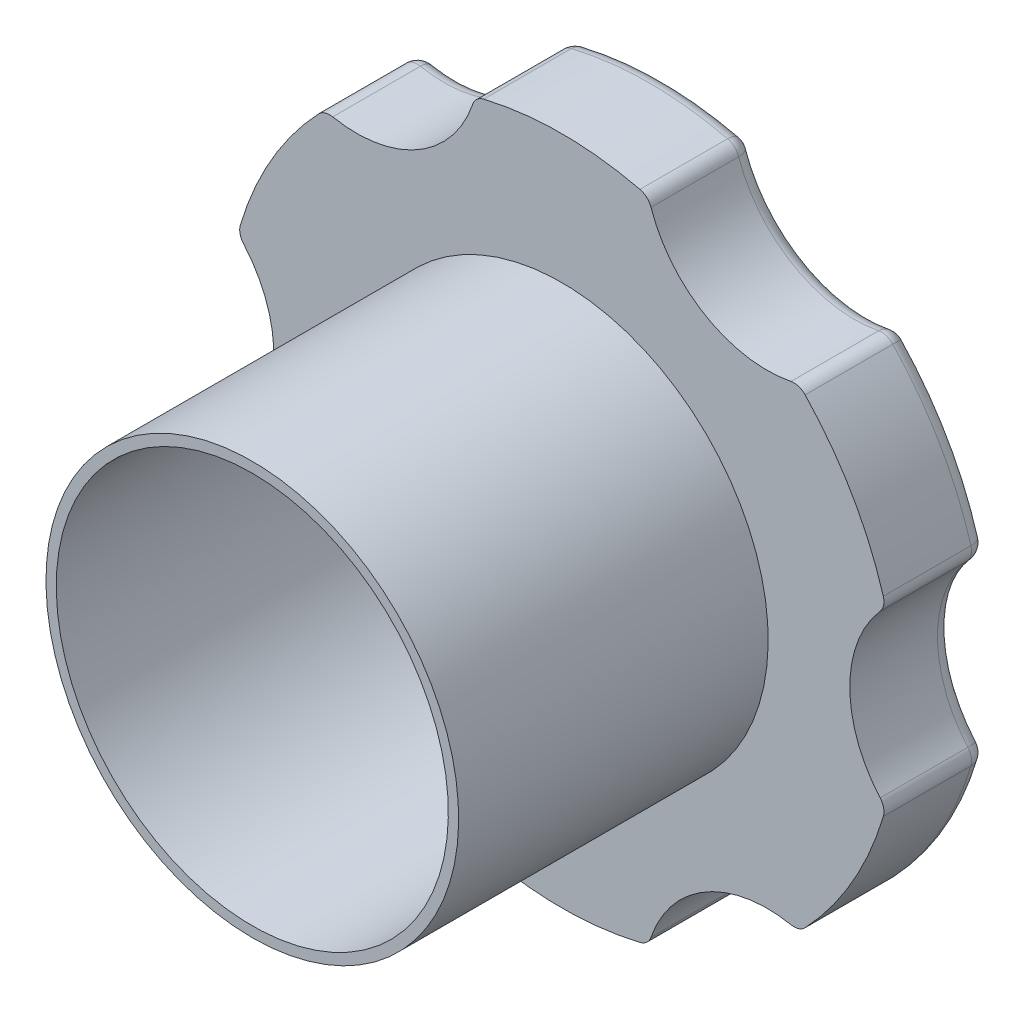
ISO-10303-21;
HEADER;
FILE_DESCRIPTION(('STEP AP214'),'2;1');
FILE_NAME('part.step','',(''),(''),'','','');
FILE_SCHEMA(('AUTOMOTIVE_DESIGN { 1 0 10303 214 1 1 1 1 }'));
ENDSEC;
DATA;
#1=APPLICATION_CONTEXT('core data for automotive mechanical design processes');
#2=APPLICATION_PROTOCOL_DEFINITION('international standard','automotive_design',2000,#1);
#3=PRODUCT_CONTEXT('',#1,'mechanical');
#4=PRODUCT('Part','Part','',(#3));
#5=PRODUCT_RELATED_PRODUCT_CATEGORY('part','',(#4));
#6=PRODUCT_DEFINITION_FORMATION('','',#4);
#7=PRODUCT_DEFINITION_CONTEXT('part definition',#1,'design');
#8=PRODUCT_DEFINITION('design','',#6,#7);
#9=PRODUCT_DEFINITION_SHAPE('','',#8);
#10=(LENGTH_UNIT() NAMED_UNIT(*) SI_UNIT(.MILLI.,.METRE.));
#11=(NAMED_UNIT(*) PLANE_ANGLE_UNIT() SI_UNIT($,.RADIAN.));
#12=(NAMED_UNIT(*) SI_UNIT($,.STERADIAN.) SOLID_ANGLE_UNIT());
#13=UNCERTAINTY_MEASURE_WITH_UNIT(LENGTH_MEASURE(1.E-05),#10,'distance_accuracy_value','');
#14=(GEOMETRIC_REPRESENTATION_CONTEXT(3) GLOBAL_UNCERTAINTY_ASSIGNED_CONTEXT((#13)) GLOBAL_UNIT_ASSIGNED_CONTEXT((#10,
#11,#12)) REPRESENTATION_CONTEXT('',''));
#15=CARTESIAN_POINT('',(0.,0.,0.));
#16=DIRECTION('',(0.,0.,1.));
#17=DIRECTION('',(1.,0.,0.));
#18=AXIS2_PLACEMENT_3D('',#15,#16,#17);
#19=CARTESIAN_POINT('',(0.,0.,-18.5));
#20=DIRECTION('',(0.,0.,1.));
#21=DIRECTION('',(0.,-1.,0.));
#22=AXIS2_PLACEMENT_3D('',#19,#20,#21);
#23=TOROIDAL_SURFACE('',#22,31.,1.5);
#24=CARTESIAN_POINT('',(0.,0.,-20.));
#25=DIRECTION('',(0.,0.,1.));
#26=DIRECTION('',(0.,-1.,0.));
#27=AXIS2_PLACEMENT_3D('',#24,#25,#26);
#28=CIRCLE('',#27,31.);
#29=CARTESIAN_POINT('',(29.7195567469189,8.81747961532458,-20.));
#30=VERTEX_POINT('',#29);
#31=CARTESIAN_POINT('',(22.4959397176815,21.3291513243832,-20.));
#32=VERTEX_POINT('',#31);
#33=EDGE_CURVE('E920',#30,#32,#28,.T.);
#34=ORIENTED_EDGE('',*,*,#33,.T.);
#35=CARTESIAN_POINT('',(22.4959397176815,21.3291513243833,-18.5));
#36=DIRECTION('',(-0.688037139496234,0.72567547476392,0.));
#37=DIRECTION('',(-0.72567547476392,-0.688037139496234,0.));
#38=AXIS2_PLACEMENT_3D('',#35,#36,#37);
#39=CIRCLE('',#38,1.5);
#40=CARTESIAN_POINT('',(23.5844529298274,22.3612070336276,-18.5));
#41=VERTEX_POINT('',#40);
#42=EDGE_CURVE('E598',#32,#41,#39,.F.);
#43=ORIENTED_EDGE('',*,*,#42,.T.);
#44=CARTESIAN_POINT('',(0.,0.,-18.5));
#45=DIRECTION('',(0.,0.,1.));
#46=DIRECTION('',(0.,-1.,0.));
#47=AXIS2_PLACEMENT_3D('',#44,#45,#46);
#48=CIRCLE('',#47,32.5);
#49=CARTESIAN_POINT('',(31.1575998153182,9.24413185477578,-18.5));
#50=VERTEX_POINT('',#49);
#51=EDGE_CURVE('E870',#50,#41,#48,.T.);
#52=ORIENTED_EDGE('',*,*,#51,.F.);
#53=CARTESIAN_POINT('',(29.7195567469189,8.81747961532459,-18.5));
#54=DIRECTION('',(-0.284434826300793,0.958695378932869,0.));
#55=DIRECTION('',(-0.958695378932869,-0.284434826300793,0.));
#56=AXIS2_PLACEMENT_3D('',#53,#54,#55);
#57=CIRCLE('',#56,1.5);
#58=EDGE_CURVE('E595',#50,#30,#57,.T.);
#59=ORIENTED_EDGE('',*,*,#58,.T.);
#60=EDGE_LOOP('',(#34,#43,#52,#59));
#61=FACE_BOUND('',#60,.T.);
#62=ADVANCED_FACE('F38',(#61),#23,.T.);
#63=CARTESIAN_POINT('',(22.4959397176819,-21.3291513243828,-20.));
#64=VERTEX_POINT('',#63);
#65=CARTESIAN_POINT('',(29.7195567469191,-8.81747961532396,-20.));
#66=VERTEX_POINT('',#65);
#67=EDGE_CURVE('E564',#64,#66,#28,.T.);
#68=ORIENTED_EDGE('',*,*,#67,.T.);
#69=CARTESIAN_POINT('',(29.7195567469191,-8.81747961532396,-18.5));
#70=DIRECTION('',(0.284434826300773,0.958695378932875,0.));
#71=DIRECTION('',(-0.958695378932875,0.284434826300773,0.));
#72=AXIS2_PLACEMENT_3D('',#69,#70,#71);
#73=CIRCLE('',#72,1.5);
#74=CARTESIAN_POINT('',(31.1575998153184,-9.24413185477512,-18.5));
#75=VERTEX_POINT('',#74);
#76=EDGE_CURVE('E656',#66,#75,#73,.F.);
#77=ORIENTED_EDGE('',*,*,#76,.T.);
#78=CARTESIAN_POINT('',(23.5844529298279,-22.3612070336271,-18.5));
#79=VERTEX_POINT('',#78);
#80=EDGE_CURVE('E861',#79,#75,#48,.T.);
#81=ORIENTED_EDGE('',*,*,#80,.F.);
#82=CARTESIAN_POINT('',(22.495939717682,-21.3291513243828,-18.5));
#83=DIRECTION('',(0.688037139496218,0.725675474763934,0.));
#84=DIRECTION('',(-0.725675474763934,0.688037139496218,0.));
#85=AXIS2_PLACEMENT_3D('',#82,#83,#84);
#86=CIRCLE('',#85,1.5);
#87=EDGE_CURVE('E653',#79,#64,#86,.T.);
#88=ORIENTED_EDGE('',*,*,#87,.T.);
#89=EDGE_LOOP('',(#68,#77,#81,#88));
#90=FACE_BOUND('',#89,.T.);
#91=ADVANCED_FACE('F927',(#90),#23,.T.);
#92=CARTESIAN_POINT('',(-7.22361702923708,-30.1466309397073,-20.));
#93=VERTEX_POINT('',#92);
#94=CARTESIAN_POINT('',(7.2236170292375,-30.1466309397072,-20.));
#95=VERTEX_POINT('',#94);
#96=EDGE_CURVE('E869',#93,#95,#28,.T.);
#97=ORIENTED_EDGE('',*,*,#96,.T.);
#98=CARTESIAN_POINT('',(7.2236170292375,-30.1466309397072,-18.5));
#99=DIRECTION('',(0.972471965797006,0.233019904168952,0.));
#100=DIRECTION('',(-0.233019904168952,0.972471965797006,0.));
#101=AXIS2_PLACEMENT_3D('',#98,#99,#100);
#102=CIRCLE('',#101,1.5);
#103=CARTESIAN_POINT('',(7.57314688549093,-31.6053388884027,-18.5));
#104=VERTEX_POINT('',#103);
#105=EDGE_CURVE('E678',#95,#104,#102,.F.);
#106=ORIENTED_EDGE('',*,*,#105,.T.);
#107=CARTESIAN_POINT('',(-7.57314688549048,-31.6053388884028,-18.5));
#108=VERTEX_POINT('',#107);
#109=EDGE_CURVE('E856',#108,#104,#48,.T.);
#110=ORIENTED_EDGE('',*,*,#109,.F.);
#111=CARTESIAN_POINT('',(-7.22361702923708,-30.1466309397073,-18.5));
#112=DIRECTION('',(0.972471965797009,-0.233019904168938,0.));
#113=DIRECTION('',(0.233019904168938,0.972471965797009,0.));
#114=AXIS2_PLACEMENT_3D('',#111,#112,#113);
#115=CIRCLE('',#114,1.5);
#116=EDGE_CURVE('E675',#108,#93,#115,.T.);
#117=ORIENTED_EDGE('',*,*,#116,.T.);
#118=EDGE_LOOP('',(#97,#106,#110,#117));
#119=FACE_BOUND('',#118,.T.);
#120=ADVANCED_FACE('F964',(#119),#23,.T.);
#121=CARTESIAN_POINT('',(-22.4959397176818,21.3291513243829,-20.));
#122=VERTEX_POINT('',#121);
#123=CARTESIAN_POINT('',(-29.7195567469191,8.81747961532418,-20.));
#124=VERTEX_POINT('',#123);
#125=EDGE_CURVE('E554',#122,#124,#28,.T.);
#126=ORIENTED_EDGE('',*,*,#125,.T.);
#127=CARTESIAN_POINT('',(-29.7195567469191,8.81747961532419,-18.5));
#128=DIRECTION('',(-0.28443482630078,-0.958695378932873,0.));
#129=DIRECTION('',(0.958695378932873,-0.28443482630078,0.));
#130=AXIS2_PLACEMENT_3D('',#127,#128,#129);
#131=CIRCLE('',#130,1.5);
#132=CARTESIAN_POINT('',(-31.1575998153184,9.24413185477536,-18.5));
#133=VERTEX_POINT('',#132);
#134=EDGE_CURVE('E722',#124,#133,#131,.F.);
#135=ORIENTED_EDGE('',*,*,#134,.T.);
#136=CARTESIAN_POINT('',(-23.5844529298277,22.3612070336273,-18.5));
#137=VERTEX_POINT('',#136);
#138=EDGE_CURVE('E548',#137,#133,#48,.T.);
#139=ORIENTED_EDGE('',*,*,#138,.F.);
#140=CARTESIAN_POINT('',(-22.4959397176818,21.3291513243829,-18.5));
#141=DIRECTION('',(-0.688037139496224,-0.725675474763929,0.));
#142=DIRECTION('',(0.725675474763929,-0.688037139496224,0.));
#143=AXIS2_PLACEMENT_3D('',#140,#141,#142);
#144=CIRCLE('',#143,1.5);
#145=EDGE_CURVE('E719',#137,#122,#144,.T.);
#146=ORIENTED_EDGE('',*,*,#145,.T.);
#147=EDGE_LOOP('',(#126,#135,#139,#146));
#148=FACE_BOUND('',#147,.T.);
#149=ADVANCED_FACE('F1028',(#148),#23,.T.);
#150=CARTESIAN_POINT('',(-29.719556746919,-8.81747961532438,-20.));
#151=VERTEX_POINT('',#150);
#152=CARTESIAN_POINT('',(-22.4959397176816,-21.3291513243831,-20.));
#153=VERTEX_POINT('',#152);
#154=EDGE_CURVE('E559',#151,#153,#28,.T.);
#155=ORIENTED_EDGE('',*,*,#154,.T.);
#156=CARTESIAN_POINT('',(-22.4959397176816,-21.3291513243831,-18.5));
#157=DIRECTION('',(0.688037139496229,-0.725675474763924,0.));
#158=DIRECTION('',(0.725675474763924,0.688037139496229,0.));
#159=AXIS2_PLACEMENT_3D('',#156,#157,#158);
#160=CIRCLE('',#159,1.5);
#161=CARTESIAN_POINT('',(-23.5844529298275,-22.3612070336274,-18.5));
#162=VERTEX_POINT('',#161);
#163=EDGE_CURVE('E700',#153,#162,#160,.F.);
#164=ORIENTED_EDGE('',*,*,#163,.T.);
#165=CARTESIAN_POINT('',(-31.1575998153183,-9.24413185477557,-18.5));
#166=VERTEX_POINT('',#165);
#167=EDGE_CURVE('E553',#166,#162,#48,.T.);
#168=ORIENTED_EDGE('',*,*,#167,.F.);
#169=CARTESIAN_POINT('',(-29.719556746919,-8.81747961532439,-18.5));
#170=DIRECTION('',(0.284434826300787,-0.958695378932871,0.));
#171=DIRECTION('',(0.958695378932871,0.284434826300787,0.));
#172=AXIS2_PLACEMENT_3D('',#169,#170,#171);
#173=CIRCLE('',#172,1.5);
#174=EDGE_CURVE('E697',#166,#151,#173,.T.);
#175=ORIENTED_EDGE('',*,*,#174,.T.);
#176=EDGE_LOOP('',(#155,#164,#168,#175));
#177=FACE_BOUND('',#176,.T.);
#178=ADVANCED_FACE('F995',(#177),#23,.T.);
#179=CARTESIAN_POINT('',(0.,0.,20.));
#180=DIRECTION('',(0.,0.,1.));
#181=DIRECTION('',(0.,-1.,0.));
#182=AXIS2_PLACEMENT_3D('',#179,#180,#181);
#183=CYLINDRICAL_SURFACE('',#182,32.5);
#184=CARTESIAN_POINT('',(0.,0.,-10.));
#185=DIRECTION('',(0.,0.,1.));
#186=DIRECTION('',(0.,-1.,0.));
#187=AXIS2_PLACEMENT_3D('',#184,#185,#186);
#188=CIRCLE('',#187,32.5);
#189=CARTESIAN_POINT('',(31.1575998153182,9.24413185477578,-10.));
#190=VERTEX_POINT('',#189);
#191=CARTESIAN_POINT('',(23.5844529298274,22.3612070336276,-10.));
#192=VERTEX_POINT('',#191);
#193=EDGE_CURVE('E547',#190,#192,#188,.T.);
#194=ORIENTED_EDGE('',*,*,#193,.F.);
#195=DIRECTION('',(0.,0.,1.));
#196=VECTOR('',#195,1.);
#197=CARTESIAN_POINT('',(31.1575998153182,9.24413185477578,20.));
#198=LINE('',#197,#196);
#199=EDGE_CURVE('E604',#190,#50,#198,.F.);
#200=ORIENTED_EDGE('',*,*,#199,.T.);
#201=ORIENTED_EDGE('',*,*,#51,.T.);
#202=DIRECTION('',(0.,0.,1.));
#203=VECTOR('',#202,1.);
#204=CARTESIAN_POINT('',(23.5844529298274,22.3612070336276,20.));
#205=LINE('',#204,#203);
#206=EDGE_CURVE('E601',#41,#192,#205,.T.);
#207=ORIENTED_EDGE('',*,*,#206,.T.);
#208=EDGE_LOOP('',(#194,#200,#201,#207));
#209=FACE_BOUND('',#208,.T.);
#210=ADVANCED_FACE('F883',(#209),#183,.T.);
#211=CARTESIAN_POINT('',(23.5844529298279,-22.3612070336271,-10.));
#212=VERTEX_POINT('',#211);
#213=CARTESIAN_POINT('',(31.1575998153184,-9.24413185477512,-10.));
#214=VERTEX_POINT('',#213);
#215=EDGE_CURVE('E849',#212,#214,#188,.T.);
#216=ORIENTED_EDGE('',*,*,#215,.F.);
#217=DIRECTION('',(0.,0.,1.));
#218=VECTOR('',#217,1.);
#219=CARTESIAN_POINT('',(23.5844529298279,-22.3612070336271,20.));
#220=LINE('',#219,#218);
#221=EDGE_CURVE('E662',#212,#79,#220,.F.);
#222=ORIENTED_EDGE('',*,*,#221,.T.);
#223=ORIENTED_EDGE('',*,*,#80,.T.);
#224=DIRECTION('',(0.,0.,1.));
#225=VECTOR('',#224,1.);
#226=CARTESIAN_POINT('',(31.1575998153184,-9.24413185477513,20.));
#227=LINE('',#226,#225);
#228=EDGE_CURVE('E659',#75,#214,#227,.T.);
#229=ORIENTED_EDGE('',*,*,#228,.T.);
#230=EDGE_LOOP('',(#216,#222,#223,#229));
#231=FACE_BOUND('',#230,.T.);
#232=ADVANCED_FACE('F946',(#231),#183,.T.);
#233=CARTESIAN_POINT('',(-7.5731468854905,-31.6053388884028,-10.));
#234=VERTEX_POINT('',#233);
#235=CARTESIAN_POINT('',(7.57314688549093,-31.6053388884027,-10.));
#236=VERTEX_POINT('',#235);
#237=EDGE_CURVE('E542',#234,#236,#188,.T.);
#238=ORIENTED_EDGE('',*,*,#237,.F.);
#239=DIRECTION('',(0.,0.,1.));
#240=VECTOR('',#239,1.);
#241=CARTESIAN_POINT('',(-7.5731468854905,-31.6053388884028,20.));
#242=LINE('',#241,#240);
#243=EDGE_CURVE('E684',#234,#108,#242,.F.);
#244=ORIENTED_EDGE('',*,*,#243,.T.);
#245=ORIENTED_EDGE('',*,*,#109,.T.);
#246=DIRECTION('',(0.,0.,1.));
#247=VECTOR('',#246,1.);
#248=CARTESIAN_POINT('',(7.57314688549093,-31.6053388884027,20.));
#249=LINE('',#248,#247);
#250=EDGE_CURVE('E681',#104,#236,#249,.T.);
#251=ORIENTED_EDGE('',*,*,#250,.T.);
#252=EDGE_LOOP('',(#238,#244,#245,#251));
#253=FACE_BOUND('',#252,.T.);
#254=ADVANCED_FACE('F974',(#253),#183,.T.);
#255=CARTESIAN_POINT('',(-31.1575998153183,-9.24413185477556,-10.));
#256=VERTEX_POINT('',#255);
#257=CARTESIAN_POINT('',(-23.5844529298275,-22.3612070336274,-10.));
#258=VERTEX_POINT('',#257);
#259=EDGE_CURVE('E546',#256,#258,#188,.T.);
#260=ORIENTED_EDGE('',*,*,#259,.F.);
#261=DIRECTION('',(0.,0.,1.));
#262=VECTOR('',#261,1.);
#263=CARTESIAN_POINT('',(-31.1575998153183,-9.24413185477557,20.));
#264=LINE('',#263,#262);
#265=EDGE_CURVE('E706',#256,#166,#264,.F.);
#266=ORIENTED_EDGE('',*,*,#265,.T.);
#267=ORIENTED_EDGE('',*,*,#167,.T.);
#268=DIRECTION('',(0.,0.,1.));
#269=VECTOR('',#268,1.);
#270=CARTESIAN_POINT('',(-23.5844529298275,-22.3612070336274,20.));
#271=LINE('',#270,#269);
#272=EDGE_CURVE('E703',#162,#258,#271,.T.);
#273=ORIENTED_EDGE('',*,*,#272,.T.);
#274=EDGE_LOOP('',(#260,#266,#267,#273));
#275=FACE_BOUND('',#274,.T.);
#276=ADVANCED_FACE('F1010',(#275),#183,.T.);
#277=CARTESIAN_POINT('',(7.5731468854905,31.6053388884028,-10.));
#278=VERTEX_POINT('',#277);
#279=CARTESIAN_POINT('',(-7.57314688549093,31.6053388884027,-10.));
#280=VERTEX_POINT('',#279);
#281=EDGE_CURVE('E841',#278,#280,#188,.T.);
#282=ORIENTED_EDGE('',*,*,#281,.F.);
#283=DIRECTION('',(0.,0.,1.));
#284=VECTOR('',#283,1.);
#285=CARTESIAN_POINT('',(7.5731468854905,31.6053388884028,20.));
#286=LINE('',#285,#284);
#287=CARTESIAN_POINT('',(7.5731468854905,31.6053388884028,-18.5));
#288=VERTEX_POINT('',#287);
#289=EDGE_CURVE('E11',#278,#288,#286,.F.);
#290=ORIENTED_EDGE('',*,*,#289,.T.);
#291=CARTESIAN_POINT('',(-7.57314688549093,31.6053388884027,-18.5));
#292=VERTEX_POINT('',#291);
#293=EDGE_CURVE('E552',#288,#292,#48,.T.);
#294=ORIENTED_EDGE('',*,*,#293,.T.);
#295=DIRECTION('',(0.,0.,1.));
#296=VECTOR('',#295,1.);
#297=CARTESIAN_POINT('',(-7.57314688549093,31.6053388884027,20.));
#298=LINE('',#297,#296);
#299=EDGE_CURVE('E48',#292,#280,#298,.T.);
#300=ORIENTED_EDGE('',*,*,#299,.T.);
#301=EDGE_LOOP('',(#282,#290,#294,#300));
#302=FACE_BOUND('',#301,.T.);
#303=ADVANCED_FACE('F840',(#302),#183,.T.);
#304=CARTESIAN_POINT('',(0.,31.,-20.));
#305=DIRECTION('',(0.,0.,1.));
#306=DIRECTION('',(0.,-1.,0.));
#307=AXIS2_PLACEMENT_3D('',#304,#305,#306);
#308=PLANE('',#307);
#309=CARTESIAN_POINT('',(7.22361702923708,30.1466309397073,-20.));
#310=VERTEX_POINT('',#309);
#311=CARTESIAN_POINT('',(-7.22361702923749,30.1466309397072,-20.));
#312=VERTEX_POINT('',#311);
#313=EDGE_CURVE('E558',#310,#312,#28,.T.);
#314=ORIENTED_EDGE('',*,*,#313,.F.);
#315=CARTESIAN_POINT('',(19.902104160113,34.4714555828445,-20.));
#316=DIRECTION('',(0.,0.,1.));
#317=DIRECTION('',(0.,-1.,0.));
#318=AXIS2_PLACEMENT_3D('',#315,#316,#317);
#319=CIRCLE('',#318,13.3958256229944);
#320=EDGE_CURVE('E592',#310,#32,#319,.T.);
#321=ORIENTED_EDGE('',*,*,#320,.T.);
#322=ORIENTED_EDGE('',*,*,#33,.F.);
#323=CARTESIAN_POINT('',(39.8042083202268,4.20007574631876E-13,-20.));
#324=DIRECTION('',(0.,0.,1.));
#325=DIRECTION('',(0.,-1.,0.));
#326=AXIS2_PLACEMENT_3D('',#323,#324,#325);
#327=CIRCLE('',#326,13.3958256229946);
#328=EDGE_CURVE('E589',#30,#66,#327,.T.);
#329=ORIENTED_EDGE('',*,*,#328,.T.);
#330=ORIENTED_EDGE('',*,*,#67,.F.);
#331=CARTESIAN_POINT('',(19.9021041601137,-34.4714555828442,-20.));
#332=DIRECTION('',(0.,0.,1.));
#333=DIRECTION('',(0.,-1.,0.));
#334=AXIS2_PLACEMENT_3D('',#331,#332,#333);
#335=CIRCLE('',#334,13.3958256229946);
#336=EDGE_CURVE('E586',#64,#95,#335,.T.);
#337=ORIENTED_EDGE('',*,*,#336,.T.);
#338=ORIENTED_EDGE('',*,*,#96,.F.);
#339=CARTESIAN_POINT('',(-19.9021041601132,-34.4714555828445,-20.));
#340=DIRECTION('',(0.,0.,1.));
#341=DIRECTION('',(0.,-1.,0.));
#342=AXIS2_PLACEMENT_3D('',#339,#340,#341);
#343=CIRCLE('',#342,13.3958256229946);
#344=EDGE_CURVE('E583',#93,#153,#343,.T.);
#345=ORIENTED_EDGE('',*,*,#344,.T.);
#346=ORIENTED_EDGE('',*,*,#154,.F.);
#347=CARTESIAN_POINT('',(-39.8042083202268,-1.35103937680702E-13,-20.));
#348=DIRECTION('',(0.,0.,1.));
#349=DIRECTION('',(0.,-1.,0.));
#350=AXIS2_PLACEMENT_3D('',#347,#348,#349);
#351=CIRCLE('',#350,13.3958256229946);
#352=EDGE_CURVE('E580',#151,#124,#351,.T.);
#353=ORIENTED_EDGE('',*,*,#352,.T.);
#354=ORIENTED_EDGE('',*,*,#125,.F.);
#355=CARTESIAN_POINT('',(-19.9021041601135,34.4714555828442,-20.));
#356=DIRECTION('',(0.,0.,1.));
#357=DIRECTION('',(0.,-1.,0.));
#358=AXIS2_PLACEMENT_3D('',#355,#356,#357);
#359=CIRCLE('',#358,13.3958256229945);
#360=EDGE_CURVE('E577',#122,#312,#359,.T.);
#361=ORIENTED_EDGE('',*,*,#360,.T.);
#362=EDGE_LOOP('',(#314,#321,#322,#329,#330,#337,#338,#345,#346,#353,#354,#361));
#363=FACE_BOUND('',#362,.T.);
#364=ADVANCED_FACE('F915',(#363),#308,.F.);
#365=ORIENTED_EDGE('',*,*,#293,.F.);
#366=CARTESIAN_POINT('',(7.22361702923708,30.1466309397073,-18.5));
#367=DIRECTION('',(-0.972471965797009,0.233019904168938,0.));
#368=DIRECTION('',(-0.233019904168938,-0.972471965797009,0.));
#369=AXIS2_PLACEMENT_3D('',#366,#367,#368);
#370=CIRCLE('',#369,1.5);
#371=EDGE_CURVE('E563',#288,#310,#370,.T.);
#372=ORIENTED_EDGE('',*,*,#371,.T.);
#373=ORIENTED_EDGE('',*,*,#313,.T.);
#374=CARTESIAN_POINT('',(-7.2236170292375,30.1466309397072,-18.5));
#375=DIRECTION('',(-0.972471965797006,-0.233019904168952,0.));
#376=DIRECTION('',(0.233019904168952,-0.972471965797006,0.));
#377=AXIS2_PLACEMENT_3D('',#374,#375,#376);
#378=CIRCLE('',#377,1.5);
#379=EDGE_CURVE('E560',#312,#292,#378,.F.);
#380=ORIENTED_EDGE('',*,*,#379,.T.);
#381=EDGE_LOOP('',(#365,#372,#373,#380));
#382=FACE_BOUND('',#381,.T.);
#383=ADVANCED_FACE('F913',(#382),#23,.T.);
#384=CARTESIAN_POINT('',(-23.5844529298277,22.3612070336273,-10.));
#385=VERTEX_POINT('',#384);
#386=CARTESIAN_POINT('',(-31.1575998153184,9.24413185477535,-10.));
#387=VERTEX_POINT('',#386);
#388=EDGE_CURVE('E848',#385,#387,#188,.T.);
#389=ORIENTED_EDGE('',*,*,#388,.F.);
#390=DIRECTION('',(0.,0.,1.));
#391=VECTOR('',#390,1.);
#392=CARTESIAN_POINT('',(-23.5844529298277,22.3612070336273,20.));
#393=LINE('',#392,#391);
#394=EDGE_CURVE('E728',#385,#137,#393,.F.);
#395=ORIENTED_EDGE('',*,*,#394,.T.);
#396=ORIENTED_EDGE('',*,*,#138,.T.);
#397=DIRECTION('',(0.,0.,1.));
#398=VECTOR('',#397,1.);
#399=CARTESIAN_POINT('',(-31.1575998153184,9.24413185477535,20.));
#400=LINE('',#399,#398);
#401=EDGE_CURVE('E725',#133,#387,#400,.T.);
#402=ORIENTED_EDGE('',*,*,#401,.T.);
#403=EDGE_LOOP('',(#389,#395,#396,#402));
#404=FACE_BOUND('',#403,.T.);
#405=ADVANCED_FACE('F1041',(#404),#183,.T.);
#406=CARTESIAN_POINT('',(0.,32.5,-9.99999999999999));
#407=DIRECTION('',(0.,0.,-1.));
#408=DIRECTION('',(0.,1.,0.));
#409=AXIS2_PLACEMENT_3D('',#406,#407,#408);
#410=PLANE('',#409);
#411=CARTESIAN_POINT('',(0.,0.,-9.99999999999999));
#412=DIRECTION('',(0.,0.,1.));
#413=DIRECTION('',(0.,-1.,0.));
#414=AXIS2_PLACEMENT_3D('',#411,#412,#413);
#415=CIRCLE('',#414,20.);
#416=CARTESIAN_POINT('',(0.,-20.,-9.99999999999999));
#417=VERTEX_POINT('',#416);
#418=EDGE_CURVE('E538',#417,#417,#415,.T.);
#419=ORIENTED_EDGE('',*,*,#418,.F.);
#420=EDGE_LOOP('',(#419));
#421=FACE_BOUND('',#420,.T.);
#422=CARTESIAN_POINT('',(39.8042083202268,4.18170604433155E-13,-10.));
#423=DIRECTION('',(0.,0.,-1.));
#424=DIRECTION('',(0.,-1.,0.));
#425=AXIS2_PLACEMENT_3D('',#422,#423,#424);
#426=CIRCLE('',#425,11.8958256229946);
#427=CARTESIAN_POINT('',(30.8487874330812,-7.83014073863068,-10.));
#428=VERTEX_POINT('',#427);
#429=CARTESIAN_POINT('',(30.848787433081,7.83014073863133,-10.));
#430=VERTEX_POINT('',#429);
#431=EDGE_CURVE('E526',#428,#430,#426,.T.);
#432=ORIENTED_EDGE('',*,*,#431,.T.);
#433=CARTESIAN_POINT('',(29.7195567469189,8.81747961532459,-9.99999999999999));
#434=DIRECTION('',(0.,0.,-1.));
#435=DIRECTION('',(0.,1.,0.));
#436=AXIS2_PLACEMENT_3D('',#433,#434,#435);
#437=CIRCLE('',#436,1.5);
#438=EDGE_CURVE('E650',#430,#190,#437,.F.);
#439=ORIENTED_EDGE('',*,*,#438,.T.);
#440=ORIENTED_EDGE('',*,*,#193,.T.);
#441=CARTESIAN_POINT('',(22.4959397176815,21.3291513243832,-9.99999999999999));
#442=DIRECTION('',(0.,0.,-1.));
#443=DIRECTION('',(0.,1.,0.));
#444=AXIS2_PLACEMENT_3D('',#441,#442,#443);
#445=CIRCLE('',#444,1.5);
#446=CARTESIAN_POINT('',(22.2054945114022,22.8007632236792,-10.));
#447=VERTEX_POINT('',#446);
#448=EDGE_CURVE('E632',#192,#447,#445,.F.);
#449=ORIENTED_EDGE('',*,*,#448,.T.);
#450=CARTESIAN_POINT('',(19.902104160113,34.4714555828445,-10.));
#451=DIRECTION('',(0.,0.,-1.));
#452=DIRECTION('',(0.,1.,0.));
#453=AXIS2_PLACEMENT_3D('',#450,#451,#452);
#454=CIRCLE('',#453,11.8958256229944);
#455=CARTESIAN_POINT('',(8.64329292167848,30.6309039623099,-10.));
#456=VERTEX_POINT('',#455);
#457=EDGE_CURVE('E509',#447,#456,#454,.T.);
#458=ORIENTED_EDGE('',*,*,#457,.T.);
#459=CARTESIAN_POINT('',(7.22361702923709,30.1466309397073,-9.99999999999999));
#460=DIRECTION('',(0.,0.,-1.));
#461=DIRECTION('',(0.,1.,0.));
#462=AXIS2_PLACEMENT_3D('',#459,#460,#461);
#463=CIRCLE('',#462,1.5);
#464=EDGE_CURVE('E635',#456,#278,#463,.F.);
#465=ORIENTED_EDGE('',*,*,#464,.T.);
#466=ORIENTED_EDGE('',*,*,#281,.T.);
#467=CARTESIAN_POINT('',(-7.2236170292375,30.1466309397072,-9.99999999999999));
#468=DIRECTION('',(0.,0.,-1.));
#469=DIRECTION('',(0.,1.,0.));
#470=AXIS2_PLACEMENT_3D('',#467,#468,#469);
#471=CIRCLE('',#470,1.5);
#472=CARTESIAN_POINT('',(-8.6432929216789,30.6309039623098,-10.));
#473=VERTEX_POINT('',#472);
#474=EDGE_CURVE('E617',#280,#473,#471,.F.);
#475=ORIENTED_EDGE('',*,*,#474,.T.);
#476=CARTESIAN_POINT('',(-19.9021041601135,34.4714555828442,-10.));
#477=DIRECTION('',(0.,0.,-1.));
#478=DIRECTION('',(0.,1.,0.));
#479=AXIS2_PLACEMENT_3D('',#476,#477,#478);
#480=CIRCLE('',#479,11.8958256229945);
#481=CARTESIAN_POINT('',(-22.2054945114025,22.8007632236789,-10.));
#482=VERTEX_POINT('',#481);
#483=EDGE_CURVE('E513',#473,#482,#480,.T.);
#484=ORIENTED_EDGE('',*,*,#483,.T.);
#485=CARTESIAN_POINT('',(-22.4959397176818,21.3291513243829,-9.99999999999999));
#486=DIRECTION('',(0.,0.,-1.));
#487=DIRECTION('',(0.,1.,0.));
#488=AXIS2_PLACEMENT_3D('',#485,#486,#487);
#489=CIRCLE('',#488,1.5);
#490=EDGE_CURVE('E638',#482,#385,#489,.F.);
#491=ORIENTED_EDGE('',*,*,#490,.T.);
#492=ORIENTED_EDGE('',*,*,#388,.T.);
#493=CARTESIAN_POINT('',(-29.7195567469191,8.81747961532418,-9.99999999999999));
#494=DIRECTION('',(0.,0.,-1.));
#495=DIRECTION('',(0.,1.,0.));
#496=AXIS2_PLACEMENT_3D('',#493,#494,#495);
#497=CIRCLE('',#496,1.5);
#498=CARTESIAN_POINT('',(-30.8487874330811,7.83014073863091,-10.));
#499=VERTEX_POINT('',#498);
#500=EDGE_CURVE('E620',#387,#499,#497,.F.);
#501=ORIENTED_EDGE('',*,*,#500,.T.);
#502=CARTESIAN_POINT('',(-39.8042083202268,-1.36940907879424E-13,-10.));
#503=DIRECTION('',(0.,0.,-1.));
#504=DIRECTION('',(0.,1.,0.));
#505=AXIS2_PLACEMENT_3D('',#502,#503,#504);
#506=CIRCLE('',#505,11.8958256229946);
#507=CARTESIAN_POINT('',(-30.8487874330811,-7.83014073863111,-10.));
#508=VERTEX_POINT('',#507);
#509=EDGE_CURVE('E514',#499,#508,#506,.T.);
#510=ORIENTED_EDGE('',*,*,#509,.T.);
#511=CARTESIAN_POINT('',(-29.719556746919,-8.81747961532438,-9.99999999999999));
#512=DIRECTION('',(0.,0.,-1.));
#513=DIRECTION('',(0.,1.,0.));
#514=AXIS2_PLACEMENT_3D('',#511,#512,#513);
#515=CIRCLE('',#514,1.5);
#516=EDGE_CURVE('E641',#508,#256,#515,.F.);
#517=ORIENTED_EDGE('',*,*,#516,.T.);
#518=ORIENTED_EDGE('',*,*,#259,.T.);
#519=CARTESIAN_POINT('',(-22.4959397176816,-21.3291513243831,-10.));
#520=DIRECTION('',(0.,0.,-1.));
#521=DIRECTION('',(0.,1.,0.));
#522=AXIS2_PLACEMENT_3D('',#519,#520,#521);
#523=CIRCLE('',#522,1.5);
#524=CARTESIAN_POINT('',(-22.2054945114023,-22.800763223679,-10.));
#525=VERTEX_POINT('',#524);
#526=EDGE_CURVE('E623',#258,#525,#523,.F.);
#527=ORIENTED_EDGE('',*,*,#526,.T.);
#528=CARTESIAN_POINT('',(-19.9021041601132,-34.4714555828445,-10.));
#529=DIRECTION('',(0.,0.,-1.));
#530=DIRECTION('',(0.,-1.,0.));
#531=AXIS2_PLACEMENT_3D('',#528,#529,#530);
#532=CIRCLE('',#531,11.8958256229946);
#533=CARTESIAN_POINT('',(-8.64329292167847,-30.6309039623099,-10.));
#534=VERTEX_POINT('',#533);
#535=EDGE_CURVE('E518',#525,#534,#532,.T.);
#536=ORIENTED_EDGE('',*,*,#535,.T.);
#537=CARTESIAN_POINT('',(-7.22361702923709,-30.1466309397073,-10.));
#538=DIRECTION('',(0.,0.,-1.));
#539=DIRECTION('',(0.,1.,0.));
#540=AXIS2_PLACEMENT_3D('',#537,#538,#539);
#541=CIRCLE('',#540,1.5);
#542=EDGE_CURVE('E644',#534,#234,#541,.F.);
#543=ORIENTED_EDGE('',*,*,#542,.T.);
#544=ORIENTED_EDGE('',*,*,#237,.T.);
#545=CARTESIAN_POINT('',(7.2236170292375,-30.1466309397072,-10.));
#546=DIRECTION('',(0.,0.,-1.));
#547=DIRECTION('',(0.,1.,0.));
#548=AXIS2_PLACEMENT_3D('',#545,#546,#547);
#549=CIRCLE('',#548,1.5);
#550=CARTESIAN_POINT('',(8.64329292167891,-30.6309039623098,-10.));
#551=VERTEX_POINT('',#550);
#552=EDGE_CURVE('E626',#236,#551,#549,.F.);
#553=ORIENTED_EDGE('',*,*,#552,.T.);
#554=CARTESIAN_POINT('',(19.9021041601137,-34.4714555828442,-10.));
#555=DIRECTION('',(0.,0.,-1.));
#556=DIRECTION('',(0.,-1.,0.));
#557=AXIS2_PLACEMENT_3D('',#554,#555,#556);
#558=CIRCLE('',#557,11.8958256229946);
#559=CARTESIAN_POINT('',(22.2054945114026,-22.8007632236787,-10.));
#560=VERTEX_POINT('',#559);
#561=EDGE_CURVE('E522',#551,#560,#558,.T.);
#562=ORIENTED_EDGE('',*,*,#561,.T.);
#563=CARTESIAN_POINT('',(22.495939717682,-21.3291513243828,-10.));
#564=DIRECTION('',(0.,0.,-1.));
#565=DIRECTION('',(0.,1.,0.));
#566=AXIS2_PLACEMENT_3D('',#563,#564,#565);
#567=CIRCLE('',#566,1.5);
#568=EDGE_CURVE('E647',#560,#212,#567,.F.);
#569=ORIENTED_EDGE('',*,*,#568,.T.);
#570=ORIENTED_EDGE('',*,*,#215,.T.);
#571=CARTESIAN_POINT('',(29.7195567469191,-8.81747961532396,-9.99999999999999));
#572=DIRECTION('',(0.,0.,-1.));
#573=DIRECTION('',(0.,1.,0.));
#574=AXIS2_PLACEMENT_3D('',#571,#572,#573);
#575=CIRCLE('',#574,1.5);
#576=EDGE_CURVE('E629',#214,#428,#575,.F.);
#577=ORIENTED_EDGE('',*,*,#576,.T.);
#578=EDGE_LOOP('',(#432,#439,#440,#449,#458,#465,#466,#475,#484,#491,#492,#501,#510,#517,#518,
#527,#536,#543,#544,#553,#562,#569,#570,#577));
#579=FACE_BOUND('',#578,.T.);
#580=ADVANCED_FACE('F845',(#421,#579),#410,.F.);
#581=CARTESIAN_POINT('',(0.,0.,20.));
#582=DIRECTION('',(0.,0.,1.));
#583=DIRECTION('',(0.,-1.,0.));
#584=AXIS2_PLACEMENT_3D('',#581,#582,#583);
#585=CYLINDRICAL_SURFACE('',#584,20.);
#586=CARTESIAN_POINT('',(0.,0.,20.));
#587=DIRECTION('',(0.,0.,1.));
#588=DIRECTION('',(0.,-1.,0.));
#589=AXIS2_PLACEMENT_3D('',#586,#587,#588);
#590=CIRCLE('',#589,20.);
#591=CARTESIAN_POINT('',(0.,-20.,20.));
#592=VERTEX_POINT('',#591);
#593=EDGE_CURVE('E534',#592,#592,#590,.T.);
#594=ORIENTED_EDGE('',*,*,#593,.F.);
#595=EDGE_LOOP('',(#594));
#596=FACE_BOUND('',#595,.T.);
#597=ORIENTED_EDGE('',*,*,#418,.T.);
#598=EDGE_LOOP('',(#597));
#599=FACE_BOUND('',#598,.T.);
#600=ADVANCED_FACE('F1094',(#596,#599),#585,.T.);
#601=CARTESIAN_POINT('',(0.,20.,20.));
#602=DIRECTION('',(0.,0.,-1.));
#603=DIRECTION('',(0.,1.,0.));
#604=AXIS2_PLACEMENT_3D('',#601,#602,#603);
#605=PLANE('',#604);
#606=CARTESIAN_POINT('',(0.,0.,20.));
#607=DIRECTION('',(0.,0.,-1.));
#608=DIRECTION('',(0.,1.,0.));
#609=AXIS2_PLACEMENT_3D('',#606,#607,#608);
#610=CIRCLE('',#609,19.);
#611=CARTESIAN_POINT('',(0.,19.,20.));
#612=VERTEX_POINT('',#611);
#613=EDGE_CURVE('E503',#612,#612,#610,.F.);
#614=ORIENTED_EDGE('',*,*,#613,.F.);
#615=EDGE_LOOP('',(#614));
#616=FACE_BOUND('',#615,.T.);
#617=ORIENTED_EDGE('',*,*,#593,.T.);
#618=EDGE_LOOP('',(#617));
#619=FACE_BOUND('',#618,.T.);
#620=ADVANCED_FACE('F1098',(#616,#619),#605,.F.);
#621=CARTESIAN_POINT('',(-19.9021041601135,34.4714555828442,-10.));
#622=DIRECTION('',(0.,0.,-1.));
#623=DIRECTION('',(0.,1.,0.));
#624=AXIS2_PLACEMENT_3D('',#621,#622,#623);
#625=CYLINDRICAL_SURFACE('',#624,11.8958256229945);
#626=CARTESIAN_POINT('',(-19.9021041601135,34.4714555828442,-18.5));
#627=DIRECTION('',(0.,0.,1.));
#628=DIRECTION('',(0.,-1.,0.));
#629=AXIS2_PLACEMENT_3D('',#626,#627,#628);
#630=CIRCLE('',#629,11.8958256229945);
#631=CARTESIAN_POINT('',(-8.6432929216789,30.6309039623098,-18.5));
#632=VERTEX_POINT('',#631);
#633=CARTESIAN_POINT('',(-22.2054945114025,22.8007632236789,-18.5));
#634=VERTEX_POINT('',#633);
#635=EDGE_CURVE('E56',#632,#634,#630,.F.);
#636=ORIENTED_EDGE('',*,*,#635,.T.);
#637=DIRECTION('',(0.,0.,-1.));
#638=VECTOR('',#637,1.);
#639=CARTESIAN_POINT('',(-22.2054945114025,22.8007632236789,-10.));
#640=LINE('',#639,#638);
#641=EDGE_CURVE('E736',#634,#482,#640,.F.);
#642=ORIENTED_EDGE('',*,*,#641,.T.);
#643=ORIENTED_EDGE('',*,*,#483,.F.);
#644=DIRECTION('',(0.,0.,-1.));
#645=VECTOR('',#644,1.);
#646=CARTESIAN_POINT('',(-8.6432929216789,30.6309039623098,-10.));
#647=LINE('',#646,#645);
#648=EDGE_CURVE('E61',#473,#632,#647,.T.);
#649=ORIENTED_EDGE('',*,*,#648,.T.);
#650=EDGE_LOOP('',(#636,#642,#643,#649));
#651=FACE_BOUND('',#650,.T.);
#652=ADVANCED_FACE('F1113',(#651),#625,.F.);
#653=CARTESIAN_POINT('',(19.902104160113,34.4714555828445,-10.));
#654=DIRECTION('',(0.,0.,-1.));
#655=DIRECTION('',(0.,1.,0.));
#656=AXIS2_PLACEMENT_3D('',#653,#654,#655);
#657=CYLINDRICAL_SURFACE('',#656,11.8958256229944);
#658=CARTESIAN_POINT('',(19.902104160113,34.4714555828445,-18.5));
#659=DIRECTION('',(0.,0.,1.));
#660=DIRECTION('',(0.,-1.,0.));
#661=AXIS2_PLACEMENT_3D('',#658,#659,#660);
#662=CIRCLE('',#661,11.8958256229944);
#663=CARTESIAN_POINT('',(22.2054945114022,22.8007632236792,-18.5));
#664=VERTEX_POINT('',#663);
#665=CARTESIAN_POINT('',(8.64329292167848,30.6309039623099,-18.5));
#666=VERTEX_POINT('',#665);
#667=EDGE_CURVE('E571',#664,#666,#662,.F.);
#668=ORIENTED_EDGE('',*,*,#667,.T.);
#669=DIRECTION('',(0.,0.,-1.));
#670=VECTOR('',#669,1.);
#671=CARTESIAN_POINT('',(8.64329292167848,30.6309039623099,-10.));
#672=LINE('',#671,#670);
#673=EDGE_CURVE('E574',#666,#456,#672,.F.);
#674=ORIENTED_EDGE('',*,*,#673,.T.);
#675=ORIENTED_EDGE('',*,*,#457,.F.);
#676=DIRECTION('',(0.,0.,-1.));
#677=VECTOR('',#676,1.);
#678=CARTESIAN_POINT('',(22.2054945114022,22.8007632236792,-10.));
#679=LINE('',#678,#677);
#680=EDGE_CURVE('E568',#447,#664,#679,.T.);
#681=ORIENTED_EDGE('',*,*,#680,.T.);
#682=EDGE_LOOP('',(#668,#674,#675,#681));
#683=FACE_BOUND('',#682,.T.);
#684=ADVANCED_FACE('F902',(#683),#657,.F.);
#685=CARTESIAN_POINT('',(-39.8042083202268,-1.36940907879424E-13,-10.));
#686=DIRECTION('',(0.,0.,-1.));
#687=DIRECTION('',(0.,1.,0.));
#688=AXIS2_PLACEMENT_3D('',#685,#686,#687);
#689=CYLINDRICAL_SURFACE('',#688,11.8958256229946);
#690=CARTESIAN_POINT('',(-39.8042083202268,-1.35379483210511E-13,-18.5));
#691=DIRECTION('',(0.,0.,1.));
#692=DIRECTION('',(0.,-1.,0.));
#693=AXIS2_PLACEMENT_3D('',#690,#691,#692);
#694=CIRCLE('',#693,11.8958256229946);
#695=CARTESIAN_POINT('',(-30.8487874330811,7.83014073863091,-18.5));
#696=VERTEX_POINT('',#695);
#697=CARTESIAN_POINT('',(-30.8487874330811,-7.83014073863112,-18.5));
#698=VERTEX_POINT('',#697);
#699=EDGE_CURVE('E713',#696,#698,#694,.F.);
#700=ORIENTED_EDGE('',*,*,#699,.T.);
#701=DIRECTION('',(0.,0.,-1.));
#702=VECTOR('',#701,1.);
#703=CARTESIAN_POINT('',(-30.8487874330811,-7.83014073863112,-10.));
#704=LINE('',#703,#702);
#705=EDGE_CURVE('E716',#698,#508,#704,.F.);
#706=ORIENTED_EDGE('',*,*,#705,.T.);
#707=ORIENTED_EDGE('',*,*,#509,.F.);
#708=DIRECTION('',(0.,0.,-1.));
#709=VECTOR('',#708,1.);
#710=CARTESIAN_POINT('',(-30.8487874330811,7.83014073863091,-10.));
#711=LINE('',#710,#709);
#712=EDGE_CURVE('E710',#499,#696,#711,.T.);
#713=ORIENTED_EDGE('',*,*,#712,.T.);
#714=EDGE_LOOP('',(#700,#706,#707,#713));
#715=FACE_BOUND('',#714,.T.);
#716=ADVANCED_FACE('F1127',(#715),#689,.F.);
#717=CARTESIAN_POINT('',(-19.9021041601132,-34.4714555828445,-10.));
#718=DIRECTION('',(0.,0.,-1.));
#719=DIRECTION('',(0.,1.,0.));
#720=AXIS2_PLACEMENT_3D('',#717,#718,#719);
#721=CYLINDRICAL_SURFACE('',#720,11.8958256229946);
#722=CARTESIAN_POINT('',(-19.9021041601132,-34.4714555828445,-18.5));
#723=DIRECTION('',(0.,0.,1.));
#724=DIRECTION('',(0.,-1.,0.));
#725=AXIS2_PLACEMENT_3D('',#722,#723,#724);
#726=CIRCLE('',#725,11.8958256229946);
#727=CARTESIAN_POINT('',(-22.2054945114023,-22.800763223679,-18.5));
#728=VERTEX_POINT('',#727);
#729=CARTESIAN_POINT('',(-8.64329292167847,-30.6309039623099,-18.5));
#730=VERTEX_POINT('',#729);
#731=EDGE_CURVE('E691',#728,#730,#726,.F.);
#732=ORIENTED_EDGE('',*,*,#731,.T.);
#733=DIRECTION('',(0.,0.,-1.));
#734=VECTOR('',#733,1.);
#735=CARTESIAN_POINT('',(-8.64329292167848,-30.6309039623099,-10.));
#736=LINE('',#735,#734);
#737=EDGE_CURVE('E694',#730,#534,#736,.F.);
#738=ORIENTED_EDGE('',*,*,#737,.T.);
#739=ORIENTED_EDGE('',*,*,#535,.F.);
#740=DIRECTION('',(0.,0.,-1.));
#741=VECTOR('',#740,1.);
#742=CARTESIAN_POINT('',(-22.2054945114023,-22.800763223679,-10.));
#743=LINE('',#742,#741);
#744=EDGE_CURVE('E688',#525,#728,#743,.T.);
#745=ORIENTED_EDGE('',*,*,#744,.T.);
#746=EDGE_LOOP('',(#732,#738,#739,#745));
#747=FACE_BOUND('',#746,.T.);
#748=ADVANCED_FACE('F1134',(#747),#721,.F.);
#749=CARTESIAN_POINT('',(19.9021041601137,-34.4714555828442,-10.));
#750=DIRECTION('',(0.,0.,-1.));
#751=DIRECTION('',(0.,1.,0.));
#752=AXIS2_PLACEMENT_3D('',#749,#750,#751);
#753=CYLINDRICAL_SURFACE('',#752,11.8958256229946);
#754=CARTESIAN_POINT('',(19.9021041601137,-34.4714555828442,-18.5));
#755=DIRECTION('',(0.,0.,1.));
#756=DIRECTION('',(0.,-1.,0.));
#757=AXIS2_PLACEMENT_3D('',#754,#755,#756);
#758=CIRCLE('',#757,11.8958256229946);
#759=CARTESIAN_POINT('',(8.64329292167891,-30.6309039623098,-18.5));
#760=VERTEX_POINT('',#759);
#761=CARTESIAN_POINT('',(22.2054945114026,-22.8007632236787,-18.5));
#762=VERTEX_POINT('',#761);
#763=EDGE_CURVE('E669',#760,#762,#758,.F.);
#764=ORIENTED_EDGE('',*,*,#763,.T.);
#765=DIRECTION('',(0.,0.,-1.));
#766=VECTOR('',#765,1.);
#767=CARTESIAN_POINT('',(22.2054945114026,-22.8007632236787,-10.));
#768=LINE('',#767,#766);
#769=EDGE_CURVE('E672',#762,#560,#768,.F.);
#770=ORIENTED_EDGE('',*,*,#769,.T.);
#771=ORIENTED_EDGE('',*,*,#561,.F.);
#772=DIRECTION('',(0.,0.,-1.));
#773=VECTOR('',#772,1.);
#774=CARTESIAN_POINT('',(8.6432929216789,-30.6309039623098,-10.));
#775=LINE('',#774,#773);
#776=EDGE_CURVE('E666',#551,#760,#775,.T.);
#777=ORIENTED_EDGE('',*,*,#776,.T.);
#778=EDGE_LOOP('',(#764,#770,#771,#777));
#779=FACE_BOUND('',#778,.T.);
#780=ADVANCED_FACE('F1142',(#779),#753,.F.);
#781=CARTESIAN_POINT('',(39.8042083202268,4.18170604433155E-13,-10.));
#782=DIRECTION('',(0.,0.,-1.));
#783=DIRECTION('',(0.,1.,0.));
#784=AXIS2_PLACEMENT_3D('',#781,#782,#783);
#785=CYLINDRICAL_SURFACE('',#784,11.8958256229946);
#786=CARTESIAN_POINT('',(39.8042083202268,4.19732029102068E-13,-18.5));
#787=DIRECTION('',(0.,0.,1.));
#788=DIRECTION('',(0.,-1.,0.));
#789=AXIS2_PLACEMENT_3D('',#786,#787,#788);
#790=CIRCLE('',#789,11.8958256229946);
#791=CARTESIAN_POINT('',(30.8487874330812,-7.83014073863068,-18.5));
#792=VERTEX_POINT('',#791);
#793=CARTESIAN_POINT('',(30.848787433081,7.83014073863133,-18.5));
#794=VERTEX_POINT('',#793);
#795=EDGE_CURVE('E611',#792,#794,#790,.F.);
#796=ORIENTED_EDGE('',*,*,#795,.T.);
#797=DIRECTION('',(0.,0.,-1.));
#798=VECTOR('',#797,1.);
#799=CARTESIAN_POINT('',(30.848787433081,7.83014073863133,-10.));
#800=LINE('',#799,#798);
#801=EDGE_CURVE('E614',#794,#430,#800,.F.);
#802=ORIENTED_EDGE('',*,*,#801,.T.);
#803=ORIENTED_EDGE('',*,*,#431,.F.);
#804=DIRECTION('',(0.,0.,-1.));
#805=VECTOR('',#804,1.);
#806=CARTESIAN_POINT('',(30.8487874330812,-7.83014073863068,-10.));
#807=LINE('',#806,#805);
#808=EDGE_CURVE('E608',#428,#792,#807,.T.);
#809=ORIENTED_EDGE('',*,*,#808,.T.);
#810=EDGE_LOOP('',(#796,#802,#803,#809));
#811=FACE_BOUND('',#810,.T.);
#812=ADVANCED_FACE('F941',(#811),#785,.F.);
#813=CARTESIAN_POINT('',(22.4959397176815,21.3291513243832,20.));
#814=DIRECTION('',(0.,0.,1.));
#815=DIRECTION('',(0.,-1.,0.));
#816=AXIS2_PLACEMENT_3D('',#813,#814,#815);
#817=CYLINDRICAL_SURFACE('',#816,1.5);
#818=ORIENTED_EDGE('',*,*,#448,.F.);
#819=ORIENTED_EDGE('',*,*,#206,.F.);
#820=CARTESIAN_POINT('',(22.4959397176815,21.3291513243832,-18.5));
#821=DIRECTION('',(0.,0.,-1.));
#822=DIRECTION('',(-1.,0.,0.));
#823=AXIS2_PLACEMENT_3D('',#820,#821,#822);
#824=CIRCLE('',#823,1.5);
#825=EDGE_CURVE('E530',#664,#41,#824,.T.);
#826=ORIENTED_EDGE('',*,*,#825,.F.);
#827=ORIENTED_EDGE('',*,*,#680,.F.);
#828=EDGE_LOOP('',(#818,#819,#826,#827));
#829=FACE_BOUND('',#828,.T.);
#830=ADVANCED_FACE('F889',(#829),#817,.T.);
#831=CARTESIAN_POINT('',(22.4959397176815,21.3291513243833,-18.5));
#832=DIRECTION('',(0.19363013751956,-0.981074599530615,0.));
#833=DIRECTION('',(0.981074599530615,0.19363013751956,0.));
#834=AXIS2_PLACEMENT_3D('',#831,#832,#833);
#835=SPHERICAL_SURFACE('',#834,1.5);
#836=ORIENTED_EDGE('',*,*,#825,.T.);
#837=ORIENTED_EDGE('',*,*,#42,.F.);
#838=CARTESIAN_POINT('',(22.4959397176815,21.3291513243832,-18.5));
#839=DIRECTION('',(-0.981074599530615,-0.193630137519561,0.));
#840=DIRECTION('',(0.193630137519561,-0.981074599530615,0.));
#841=AXIS2_PLACEMENT_3D('',#838,#839,#840);
#842=CIRCLE('',#841,1.5);
#843=EDGE_CURVE('E749',#664,#32,#842,.T.);
#844=ORIENTED_EDGE('',*,*,#843,.F.);
#845=EDGE_LOOP('',(#836,#837,#844));
#846=FACE_BOUND('',#845,.T.);
#847=ADVANCED_FACE('F894',(#846),#835,.T.);
#848=CARTESIAN_POINT('',(7.22361702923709,30.1466309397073,-10.));
#849=DIRECTION('',(0.,0.,1.));
#850=DIRECTION('',(0.,-1.,0.));
#851=AXIS2_PLACEMENT_3D('',#848,#849,#850);
#852=CYLINDRICAL_SURFACE('',#851,1.5);
#853=ORIENTED_EDGE('',*,*,#464,.F.);
#854=ORIENTED_EDGE('',*,*,#673,.F.);
#855=CARTESIAN_POINT('',(7.22361702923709,30.1466309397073,-18.5));
#856=DIRECTION('',(0.,0.,-1.));
#857=DIRECTION('',(-1.,0.,0.));
#858=AXIS2_PLACEMENT_3D('',#855,#856,#857);
#859=CIRCLE('',#858,1.5);
#860=EDGE_CURVE('E744',#288,#666,#859,.T.);
#861=ORIENTED_EDGE('',*,*,#860,.F.);
#862=ORIENTED_EDGE('',*,*,#289,.F.);
#863=EDGE_LOOP('',(#853,#854,#861,#862));
#864=FACE_BOUND('',#863,.T.);
#865=ADVANCED_FACE('F906',(#864),#852,.T.);
#866=CARTESIAN_POINT('',(19.902104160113,34.4714555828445,-18.5));
#867=DIRECTION('',(0.,0.,1.));
#868=DIRECTION('',(0.,-1.,0.));
#869=AXIS2_PLACEMENT_3D('',#866,#867,#868);
#870=TOROIDAL_SURFACE('',#869,13.3958256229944,1.5);
#871=ORIENTED_EDGE('',*,*,#843,.T.);
#872=ORIENTED_EDGE('',*,*,#320,.F.);
#873=CARTESIAN_POINT('',(7.22361702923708,30.1466309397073,-18.5));
#874=DIRECTION('',(-0.322848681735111,0.946450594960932,0.));
#875=DIRECTION('',(-0.946450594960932,-0.322848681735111,0.));
#876=AXIS2_PLACEMENT_3D('',#873,#874,#875);
#877=CIRCLE('',#876,1.5);
#878=EDGE_CURVE('E741',#666,#310,#877,.T.);
#879=ORIENTED_EDGE('',*,*,#878,.F.);
#880=ORIENTED_EDGE('',*,*,#667,.F.);
#881=EDGE_LOOP('',(#871,#872,#879,#880));
#882=FACE_BOUND('',#881,.T.);
#883=ADVANCED_FACE('F899',(#882),#870,.T.);
#884=CARTESIAN_POINT('',(7.22361702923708,30.1466309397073,-18.5));
#885=DIRECTION('',(-0.946450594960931,-0.322848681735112,0.));
#886=DIRECTION('',(0.322848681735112,-0.946450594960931,0.));
#887=AXIS2_PLACEMENT_3D('',#884,#885,#886);
#888=SPHERICAL_SURFACE('',#887,1.5);
#889=ORIENTED_EDGE('',*,*,#371,.F.);
#890=ORIENTED_EDGE('',*,*,#860,.T.);
#891=ORIENTED_EDGE('',*,*,#878,.T.);
#892=EDGE_LOOP('',(#889,#890,#891));
#893=FACE_BOUND('',#892,.T.);
#894=ADVANCED_FACE('F909',(#893),#888,.T.);
#895=CARTESIAN_POINT('',(29.7195567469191,-8.81747961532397,20.));
#896=DIRECTION('',(0.,0.,1.));
#897=DIRECTION('',(0.,-1.,0.));
#898=AXIS2_PLACEMENT_3D('',#895,#896,#897);
#899=CYLINDRICAL_SURFACE('',#898,1.5);
#900=ORIENTED_EDGE('',*,*,#576,.F.);
#901=ORIENTED_EDGE('',*,*,#228,.F.);
#902=CARTESIAN_POINT('',(29.7195567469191,-8.81747961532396,-18.5));
#903=DIRECTION('',(0.,0.,-1.));
#904=DIRECTION('',(0.,1.,0.));
#905=AXIS2_PLACEMENT_3D('',#902,#903,#904);
#906=CIRCLE('',#905,1.5);
#907=EDGE_CURVE('E745',#792,#75,#906,.T.);
#908=ORIENTED_EDGE('',*,*,#907,.F.);
#909=ORIENTED_EDGE('',*,*,#808,.F.);
#910=EDGE_LOOP('',(#900,#901,#908,#909));
#911=FACE_BOUND('',#910,.T.);
#912=ADVANCED_FACE('F945',(#911),#899,.T.);
#913=CARTESIAN_POINT('',(29.7195567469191,-8.81747961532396,-18.5));
#914=DIRECTION('',(-0.752820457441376,-0.658225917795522,0.));
#915=DIRECTION('',(0.658225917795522,-0.752820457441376,0.));
#916=AXIS2_PLACEMENT_3D('',#913,#914,#915);
#917=SPHERICAL_SURFACE('',#916,1.5);
#918=ORIENTED_EDGE('',*,*,#907,.T.);
#919=ORIENTED_EDGE('',*,*,#76,.F.);
#920=CARTESIAN_POINT('',(29.7195567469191,-8.81747961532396,-18.5));
#921=DIRECTION('',(-0.658225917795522,0.752820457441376,0.));
#922=DIRECTION('',(-0.752820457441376,-0.658225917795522,0.));
#923=AXIS2_PLACEMENT_3D('',#920,#921,#922);
#924=CIRCLE('',#923,1.5);
#925=EDGE_CURVE('E764',#792,#66,#924,.T.);
#926=ORIENTED_EDGE('',*,*,#925,.F.);
#927=EDGE_LOOP('',(#918,#919,#926));
#928=FACE_BOUND('',#927,.T.);
#929=ADVANCED_FACE('F932',(#928),#917,.T.);
#930=CARTESIAN_POINT('',(39.8042083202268,4.19732029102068E-13,-18.5));
#931=DIRECTION('',(0.,0.,1.));
#932=DIRECTION('',(0.,-1.,0.));
#933=AXIS2_PLACEMENT_3D('',#930,#931,#932);
#934=TOROIDAL_SURFACE('',#933,13.3958256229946,1.5);
#935=ORIENTED_EDGE('',*,*,#925,.T.);
#936=ORIENTED_EDGE('',*,*,#328,.F.);
#937=CARTESIAN_POINT('',(29.7195567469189,8.81747961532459,-18.5));
#938=DIRECTION('',(0.658225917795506,0.75282045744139,0.));
#939=DIRECTION('',(-0.75282045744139,0.658225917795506,0.));
#940=AXIS2_PLACEMENT_3D('',#937,#938,#939);
#941=CIRCLE('',#940,1.5);
#942=EDGE_CURVE('E759',#794,#30,#941,.T.);
#943=ORIENTED_EDGE('',*,*,#942,.F.);
#944=ORIENTED_EDGE('',*,*,#795,.F.);
#945=EDGE_LOOP('',(#935,#936,#943,#944));
#946=FACE_BOUND('',#945,.T.);
#947=ADVANCED_FACE('F937',(#946),#934,.T.);
#948=CARTESIAN_POINT('',(29.7195567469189,8.81747961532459,-18.5));
#949=DIRECTION('',(-0.75282045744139,0.658225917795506,0.));
#950=DIRECTION('',(-0.658225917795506,-0.75282045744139,0.));
#951=AXIS2_PLACEMENT_3D('',#948,#949,#950);
#952=SPHERICAL_SURFACE('',#951,1.5);
#953=ORIENTED_EDGE('',*,*,#942,.T.);
#954=ORIENTED_EDGE('',*,*,#58,.F.);
#955=CARTESIAN_POINT('',(29.7195567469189,8.81747961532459,-18.5));
#956=DIRECTION('',(0.,0.,1.));
#957=DIRECTION('',(0.,-1.,0.));
#958=AXIS2_PLACEMENT_3D('',#955,#956,#957);
#959=CIRCLE('',#958,1.5);
#960=EDGE_CURVE('E756',#794,#50,#959,.T.);
#961=ORIENTED_EDGE('',*,*,#960,.F.);
#962=EDGE_LOOP('',(#953,#954,#961));
#963=FACE_BOUND('',#962,.T.);
#964=ADVANCED_FACE('F1205',(#963),#952,.T.);
#965=CARTESIAN_POINT('',(29.7195567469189,8.81747961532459,-10.));
#966=DIRECTION('',(0.,0.,1.));
#967=DIRECTION('',(0.,-1.,0.));
#968=AXIS2_PLACEMENT_3D('',#965,#966,#967);
#969=CYLINDRICAL_SURFACE('',#968,1.5);
#970=ORIENTED_EDGE('',*,*,#438,.F.);
#971=ORIENTED_EDGE('',*,*,#801,.F.);
#972=ORIENTED_EDGE('',*,*,#960,.T.);
#973=ORIENTED_EDGE('',*,*,#199,.F.);
#974=EDGE_LOOP('',(#970,#971,#972,#973));
#975=FACE_BOUND('',#974,.T.);
#976=ADVANCED_FACE('F1212',(#975),#969,.T.);
#977=CARTESIAN_POINT('',(7.2236170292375,-30.1466309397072,20.));
#978=DIRECTION('',(0.,0.,1.));
#979=DIRECTION('',(0.,-1.,0.));
#980=AXIS2_PLACEMENT_3D('',#977,#978,#979);
#981=CYLINDRICAL_SURFACE('',#980,1.5);
#982=ORIENTED_EDGE('',*,*,#552,.F.);
#983=ORIENTED_EDGE('',*,*,#250,.F.);
#984=CARTESIAN_POINT('',(7.2236170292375,-30.1466309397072,-18.5));
#985=DIRECTION('',(0.,0.,-1.));
#986=DIRECTION('',(0.,1.,0.));
#987=AXIS2_PLACEMENT_3D('',#984,#985,#986);
#988=CIRCLE('',#987,1.5);
#989=EDGE_CURVE('E760',#760,#104,#988,.T.);
#990=ORIENTED_EDGE('',*,*,#989,.F.);
#991=ORIENTED_EDGE('',*,*,#776,.F.);
#992=EDGE_LOOP('',(#982,#983,#990,#991));
#993=FACE_BOUND('',#992,.T.);
#994=ADVANCED_FACE('F972',(#993),#981,.T.);
#995=CARTESIAN_POINT('',(7.2236170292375,-30.1466309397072,-18.5));
#996=DIRECTION('',(-0.946450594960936,0.322848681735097,0.));
#997=DIRECTION('',(-0.322848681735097,-0.946450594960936,0.));
#998=AXIS2_PLACEMENT_3D('',#995,#996,#997);
#999=SPHERICAL_SURFACE('',#998,1.5);
#1000=ORIENTED_EDGE('',*,*,#989,.T.);
#1001=ORIENTED_EDGE('',*,*,#105,.F.);
#1002=CARTESIAN_POINT('',(7.2236170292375,-30.1466309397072,-18.5));
#1003=DIRECTION('',(0.322848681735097,0.946450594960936,0.));
#1004=DIRECTION('',(-0.946450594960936,0.322848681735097,0.));
#1005=AXIS2_PLACEMENT_3D('',#1002,#1003,#1004);
#1006=CIRCLE('',#1005,1.5);
#1007=EDGE_CURVE('E779',#760,#95,#1006,.T.);
#1008=ORIENTED_EDGE('',*,*,#1007,.F.);
#1009=EDGE_LOOP('',(#1000,#1001,#1008));
#1010=FACE_BOUND('',#1009,.T.);
#1011=ADVANCED_FACE('F967',(#1010),#999,.T.);
#1012=CARTESIAN_POINT('',(19.9021041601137,-34.4714555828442,-18.5));
#1013=DIRECTION('',(0.,0.,1.));
#1014=DIRECTION('',(0.,-1.,0.));
#1015=AXIS2_PLACEMENT_3D('',#1012,#1013,#1014);
#1016=TOROIDAL_SURFACE('',#1015,13.3958256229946,1.5);
#1017=ORIENTED_EDGE('',*,*,#1007,.T.);
#1018=ORIENTED_EDGE('',*,*,#336,.F.);
#1019=CARTESIAN_POINT('',(22.495939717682,-21.3291513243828,-18.5));
#1020=DIRECTION('',(0.981074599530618,-0.193630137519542,0.));
#1021=DIRECTION('',(0.193630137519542,0.981074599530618,0.));
#1022=AXIS2_PLACEMENT_3D('',#1019,#1020,#1021);
#1023=CIRCLE('',#1022,1.5);
#1024=EDGE_CURVE('E774',#762,#64,#1023,.T.);
#1025=ORIENTED_EDGE('',*,*,#1024,.F.);
#1026=ORIENTED_EDGE('',*,*,#763,.F.);
#1027=EDGE_LOOP('',(#1017,#1018,#1025,#1026));
#1028=FACE_BOUND('',#1027,.T.);
#1029=ADVANCED_FACE('F958',(#1028),#1016,.T.);
#1030=CARTESIAN_POINT('',(22.495939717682,-21.3291513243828,-18.5));
#1031=DIRECTION('',(0.193630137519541,0.981074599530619,0.));
#1032=DIRECTION('',(-0.981074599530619,0.193630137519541,0.));
#1033=AXIS2_PLACEMENT_3D('',#1030,#1031,#1032);
#1034=SPHERICAL_SURFACE('',#1033,1.5);
#1035=ORIENTED_EDGE('',*,*,#1024,.T.);
#1036=ORIENTED_EDGE('',*,*,#87,.F.);
#1037=CARTESIAN_POINT('',(22.495939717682,-21.3291513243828,-18.5));
#1038=DIRECTION('',(0.,0.,1.));
#1039=DIRECTION('',(1.,0.,0.));
#1040=AXIS2_PLACEMENT_3D('',#1037,#1038,#1039);
#1041=CIRCLE('',#1040,1.5);
#1042=EDGE_CURVE('E771',#762,#79,#1041,.T.);
#1043=ORIENTED_EDGE('',*,*,#1042,.F.);
#1044=EDGE_LOOP('',(#1035,#1036,#1043));
#1045=FACE_BOUND('',#1044,.T.);
#1046=ADVANCED_FACE('F954',(#1045),#1034,.T.);
#1047=CARTESIAN_POINT('',(22.495939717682,-21.3291513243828,-10.));
#1048=DIRECTION('',(0.,0.,1.));
#1049=DIRECTION('',(0.,-1.,0.));
#1050=AXIS2_PLACEMENT_3D('',#1047,#1048,#1049);
#1051=CYLINDRICAL_SURFACE('',#1050,1.5);
#1052=ORIENTED_EDGE('',*,*,#568,.F.);
#1053=ORIENTED_EDGE('',*,*,#769,.F.);
#1054=ORIENTED_EDGE('',*,*,#1042,.T.);
#1055=ORIENTED_EDGE('',*,*,#221,.F.);
#1056=EDGE_LOOP('',(#1052,#1053,#1054,#1055));
#1057=FACE_BOUND('',#1056,.T.);
#1058=ADVANCED_FACE('F950',(#1057),#1051,.T.);
#1059=CARTESIAN_POINT('',(-22.4959397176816,-21.3291513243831,20.));
#1060=DIRECTION('',(0.,0.,1.));
#1061=DIRECTION('',(0.,-1.,0.));
#1062=AXIS2_PLACEMENT_3D('',#1059,#1060,#1061);
#1063=CYLINDRICAL_SURFACE('',#1062,1.5);
#1064=ORIENTED_EDGE('',*,*,#526,.F.);
#1065=ORIENTED_EDGE('',*,*,#272,.F.);
#1066=CARTESIAN_POINT('',(-22.4959397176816,-21.3291513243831,-18.5));
#1067=DIRECTION('',(0.,0.,-1.));
#1068=DIRECTION('',(-1.,0.,0.));
#1069=AXIS2_PLACEMENT_3D('',#1066,#1067,#1068);
#1070=CIRCLE('',#1069,1.5);
#1071=EDGE_CURVE('E775',#728,#162,#1070,.T.);
#1072=ORIENTED_EDGE('',*,*,#1071,.F.);
#1073=ORIENTED_EDGE('',*,*,#744,.F.);
#1074=EDGE_LOOP('',(#1064,#1065,#1072,#1073));
#1075=FACE_BOUND('',#1074,.T.);
#1076=ADVANCED_FACE('F1006',(#1075),#1063,.T.);
#1077=CARTESIAN_POINT('',(-22.4959397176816,-21.3291513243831,-18.5));
#1078=DIRECTION('',(-0.193630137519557,0.981074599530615,0.));
#1079=DIRECTION('',(-0.981074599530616,-0.193630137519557,0.));
#1080=AXIS2_PLACEMENT_3D('',#1077,#1078,#1079);
#1081=SPHERICAL_SURFACE('',#1080,1.5);
#1082=ORIENTED_EDGE('',*,*,#1071,.T.);
#1083=ORIENTED_EDGE('',*,*,#163,.F.);
#1084=CARTESIAN_POINT('',(-22.4959397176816,-21.3291513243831,-18.5));
#1085=DIRECTION('',(0.981074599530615,0.193630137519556,0.));
#1086=DIRECTION('',(-0.193630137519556,0.981074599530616,0.));
#1087=AXIS2_PLACEMENT_3D('',#1084,#1085,#1086);
#1088=CIRCLE('',#1087,1.5);
#1089=EDGE_CURVE('E794',#728,#153,#1088,.T.);
#1090=ORIENTED_EDGE('',*,*,#1089,.F.);
#1091=EDGE_LOOP('',(#1082,#1083,#1090));
#1092=FACE_BOUND('',#1091,.T.);
#1093=ADVANCED_FACE('F1000',(#1092),#1081,.T.);
#1094=CARTESIAN_POINT('',(-19.9021041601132,-34.4714555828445,-18.5));
#1095=DIRECTION('',(0.,0.,1.));
#1096=DIRECTION('',(0.,-1.,0.));
#1097=AXIS2_PLACEMENT_3D('',#1094,#1095,#1096);
#1098=TOROIDAL_SURFACE('',#1097,13.3958256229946,1.5);
#1099=ORIENTED_EDGE('',*,*,#1089,.T.);
#1100=ORIENTED_EDGE('',*,*,#344,.F.);
#1101=CARTESIAN_POINT('',(-7.22361702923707,-30.1466309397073,-18.5));
#1102=DIRECTION('',(0.322848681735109,-0.946450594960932,0.));
#1103=DIRECTION('',(0.946450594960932,0.322848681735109,0.));
#1104=AXIS2_PLACEMENT_3D('',#1101,#1102,#1103);
#1105=CIRCLE('',#1104,1.5);
#1106=EDGE_CURVE('E789',#730,#93,#1105,.T.);
#1107=ORIENTED_EDGE('',*,*,#1106,.F.);
#1108=ORIENTED_EDGE('',*,*,#731,.F.);
#1109=EDGE_LOOP('',(#1099,#1100,#1107,#1108));
#1110=FACE_BOUND('',#1109,.T.);
#1111=ADVANCED_FACE('F988',(#1110),#1098,.T.);
#1112=CARTESIAN_POINT('',(-7.22361702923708,-30.1466309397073,-18.5));
#1113=DIRECTION('',(0.946450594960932,0.322848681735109,0.));
#1114=DIRECTION('',(-0.322848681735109,0.946450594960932,0.));
#1115=AXIS2_PLACEMENT_3D('',#1112,#1113,#1114);
#1116=SPHERICAL_SURFACE('',#1115,1.5);
#1117=ORIENTED_EDGE('',*,*,#1106,.T.);
#1118=ORIENTED_EDGE('',*,*,#116,.F.);
#1119=CARTESIAN_POINT('',(-7.22361702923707,-30.1466309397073,-18.5));
#1120=DIRECTION('',(0.,0.,1.));
#1121=DIRECTION('',(0.,-1.,0.));
#1122=AXIS2_PLACEMENT_3D('',#1119,#1120,#1121);
#1123=CIRCLE('',#1122,1.5);
#1124=EDGE_CURVE('E786',#730,#108,#1123,.T.);
#1125=ORIENTED_EDGE('',*,*,#1124,.F.);
#1126=EDGE_LOOP('',(#1117,#1118,#1125));
#1127=FACE_BOUND('',#1126,.T.);
#1128=ADVANCED_FACE('F984',(#1127),#1116,.T.);
#1129=CARTESIAN_POINT('',(-7.22361702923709,-30.1466309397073,-10.));
#1130=DIRECTION('',(0.,0.,1.));
#1131=DIRECTION('',(0.,-1.,0.));
#1132=AXIS2_PLACEMENT_3D('',#1129,#1130,#1131);
#1133=CYLINDRICAL_SURFACE('',#1132,1.5);
#1134=ORIENTED_EDGE('',*,*,#542,.F.);
#1135=ORIENTED_EDGE('',*,*,#737,.F.);
#1136=ORIENTED_EDGE('',*,*,#1124,.T.);
#1137=ORIENTED_EDGE('',*,*,#243,.F.);
#1138=EDGE_LOOP('',(#1134,#1135,#1136,#1137));
#1139=FACE_BOUND('',#1138,.T.);
#1140=ADVANCED_FACE('F981',(#1139),#1133,.T.);
#1141=CARTESIAN_POINT('',(-29.7195567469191,8.81747961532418,20.));
#1142=DIRECTION('',(0.,0.,1.));
#1143=DIRECTION('',(0.,-1.,0.));
#1144=AXIS2_PLACEMENT_3D('',#1141,#1142,#1143);
#1145=CYLINDRICAL_SURFACE('',#1144,1.5);
#1146=ORIENTED_EDGE('',*,*,#500,.F.);
#1147=ORIENTED_EDGE('',*,*,#401,.F.);
#1148=CARTESIAN_POINT('',(-29.7195567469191,8.81747961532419,-18.5));
#1149=DIRECTION('',(0.,0.,-1.));
#1150=DIRECTION('',(0.,1.,0.));
#1151=AXIS2_PLACEMENT_3D('',#1148,#1149,#1150);
#1152=CIRCLE('',#1151,1.5);
#1153=EDGE_CURVE('E790',#696,#133,#1152,.T.);
#1154=ORIENTED_EDGE('',*,*,#1153,.F.);
#1155=ORIENTED_EDGE('',*,*,#712,.F.);
#1156=EDGE_LOOP('',(#1146,#1147,#1154,#1155));
#1157=FACE_BOUND('',#1156,.T.);
#1158=ADVANCED_FACE('F1038',(#1157),#1145,.T.);
#1159=CARTESIAN_POINT('',(-29.7195567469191,8.81747961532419,-18.5));
#1160=DIRECTION('',(0.752820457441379,0.658225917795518,0.));
#1161=DIRECTION('',(-0.658225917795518,0.752820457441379,0.));
#1162=AXIS2_PLACEMENT_3D('',#1159,#1160,#1161);
#1163=SPHERICAL_SURFACE('',#1162,1.5);
#1164=ORIENTED_EDGE('',*,*,#1153,.T.);
#1165=ORIENTED_EDGE('',*,*,#134,.F.);
#1166=CARTESIAN_POINT('',(-29.7195567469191,8.81747961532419,-18.5));
#1167=DIRECTION('',(0.658225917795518,-0.752820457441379,0.));
#1168=DIRECTION('',(0.752820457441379,0.658225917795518,0.));
#1169=AXIS2_PLACEMENT_3D('',#1166,#1167,#1168);
#1170=CIRCLE('',#1169,1.5);
#1171=EDGE_CURVE('E808',#696,#124,#1170,.T.);
#1172=ORIENTED_EDGE('',*,*,#1171,.F.);
#1173=EDGE_LOOP('',(#1164,#1165,#1172));
#1174=FACE_BOUND('',#1173,.T.);
#1175=ADVANCED_FACE('F1032',(#1174),#1163,.T.);
#1176=CARTESIAN_POINT('',(-39.8042083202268,-1.35379483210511E-13,-18.5));
#1177=DIRECTION('',(0.,0.,1.));
#1178=DIRECTION('',(0.,-1.,0.));
#1179=AXIS2_PLACEMENT_3D('',#1176,#1177,#1178);
#1180=TOROIDAL_SURFACE('',#1179,13.3958256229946,1.5);
#1181=ORIENTED_EDGE('',*,*,#1171,.T.);
#1182=ORIENTED_EDGE('',*,*,#352,.F.);
#1183=CARTESIAN_POINT('',(-29.719556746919,-8.81747961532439,-18.5));
#1184=DIRECTION('',(-0.658225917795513,-0.752820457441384,0.));
#1185=DIRECTION('',(0.752820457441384,-0.658225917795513,0.));
#1186=AXIS2_PLACEMENT_3D('',#1183,#1184,#1185);
#1187=CIRCLE('',#1186,1.5);
#1188=EDGE_CURVE('E804',#698,#151,#1187,.T.);
#1189=ORIENTED_EDGE('',*,*,#1188,.F.);
#1190=ORIENTED_EDGE('',*,*,#699,.F.);
#1191=EDGE_LOOP('',(#1181,#1182,#1189,#1190));
#1192=FACE_BOUND('',#1191,.T.);
#1193=ADVANCED_FACE('F1024',(#1192),#1180,.T.);
#1194=CARTESIAN_POINT('',(-29.719556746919,-8.81747961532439,-18.5));
#1195=DIRECTION('',(0.752820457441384,-0.658225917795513,0.));
#1196=DIRECTION('',(0.658225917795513,0.752820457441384,0.));
#1197=AXIS2_PLACEMENT_3D('',#1194,#1195,#1196);
#1198=SPHERICAL_SURFACE('',#1197,1.5);
#1199=ORIENTED_EDGE('',*,*,#1188,.T.);
#1200=ORIENTED_EDGE('',*,*,#174,.F.);
#1201=CARTESIAN_POINT('',(-29.719556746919,-8.81747961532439,-18.5));
#1202=DIRECTION('',(0.,0.,1.));
#1203=DIRECTION('',(0.,-1.,0.));
#1204=AXIS2_PLACEMENT_3D('',#1201,#1202,#1203);
#1205=CIRCLE('',#1204,1.5);
#1206=EDGE_CURVE('E801',#698,#166,#1205,.T.);
#1207=ORIENTED_EDGE('',*,*,#1206,.F.);
#1208=EDGE_LOOP('',(#1199,#1200,#1207));
#1209=FACE_BOUND('',#1208,.T.);
#1210=ADVANCED_FACE('F1020',(#1209),#1198,.T.);
#1211=CARTESIAN_POINT('',(-29.719556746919,-8.81747961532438,-10.));
#1212=DIRECTION('',(0.,0.,1.));
#1213=DIRECTION('',(0.,-1.,0.));
#1214=AXIS2_PLACEMENT_3D('',#1211,#1212,#1213);
#1215=CYLINDRICAL_SURFACE('',#1214,1.5);
#1216=ORIENTED_EDGE('',*,*,#516,.F.);
#1217=ORIENTED_EDGE('',*,*,#705,.F.);
#1218=ORIENTED_EDGE('',*,*,#1206,.T.);
#1219=ORIENTED_EDGE('',*,*,#265,.F.);
#1220=EDGE_LOOP('',(#1216,#1217,#1218,#1219));
#1221=FACE_BOUND('',#1220,.T.);
#1222=ADVANCED_FACE('F1017',(#1221),#1215,.T.);
#1223=CARTESIAN_POINT('',(-7.2236170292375,30.1466309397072,20.));
#1224=DIRECTION('',(0.,0.,1.));
#1225=DIRECTION('',(0.,-1.,0.));
#1226=AXIS2_PLACEMENT_3D('',#1223,#1224,#1225);
#1227=CYLINDRICAL_SURFACE('',#1226,1.5);
#1228=ORIENTED_EDGE('',*,*,#474,.F.);
#1229=ORIENTED_EDGE('',*,*,#299,.F.);
#1230=CARTESIAN_POINT('',(-7.2236170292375,30.1466309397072,-18.5));
#1231=DIRECTION('',(0.,0.,-1.));
#1232=DIRECTION('',(0.,1.,0.));
#1233=AXIS2_PLACEMENT_3D('',#1230,#1231,#1232);
#1234=CIRCLE('',#1233,1.5);
#1235=EDGE_CURVE('E42',#632,#292,#1234,.T.);
#1236=ORIENTED_EDGE('',*,*,#1235,.F.);
#1237=ORIENTED_EDGE('',*,*,#648,.F.);
#1238=EDGE_LOOP('',(#1228,#1229,#1236,#1237));
#1239=FACE_BOUND('',#1238,.T.);
#1240=ADVANCED_FACE('F40',(#1239),#1227,.T.);
#1241=CARTESIAN_POINT('',(-7.2236170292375,30.1466309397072,-18.5));
#1242=DIRECTION('',(0.946450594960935,-0.3228486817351,0.));
#1243=DIRECTION('',(0.3228486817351,0.946450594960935,0.));
#1244=AXIS2_PLACEMENT_3D('',#1241,#1242,#1243);
#1245=SPHERICAL_SURFACE('',#1244,1.5);
#1246=ORIENTED_EDGE('',*,*,#1235,.T.);
#1247=ORIENTED_EDGE('',*,*,#379,.F.);
#1248=CARTESIAN_POINT('',(-7.2236170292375,30.1466309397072,-18.5));
#1249=DIRECTION('',(-0.3228486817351,-0.946450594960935,0.));
#1250=DIRECTION('',(0.946450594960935,-0.3228486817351,0.));
#1251=AXIS2_PLACEMENT_3D('',#1248,#1249,#1250);
#1252=CIRCLE('',#1251,1.5);
#1253=EDGE_CURVE('E822',#632,#312,#1252,.T.);
#1254=ORIENTED_EDGE('',*,*,#1253,.F.);
#1255=EDGE_LOOP('',(#1246,#1247,#1254));
#1256=FACE_BOUND('',#1255,.T.);
#1257=ADVANCED_FACE('F832',(#1256),#1245,.T.);
#1258=CARTESIAN_POINT('',(-19.9021041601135,34.4714555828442,-18.5));
#1259=DIRECTION('',(0.,0.,1.));
#1260=DIRECTION('',(0.,-1.,0.));
#1261=AXIS2_PLACEMENT_3D('',#1258,#1259,#1260);
#1262=TOROIDAL_SURFACE('',#1261,13.3958256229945,1.5);
#1263=ORIENTED_EDGE('',*,*,#1253,.T.);
#1264=ORIENTED_EDGE('',*,*,#360,.F.);
#1265=CARTESIAN_POINT('',(-22.4959397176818,21.3291513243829,-18.5));
#1266=DIRECTION('',(-0.981074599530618,0.193630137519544,0.));
#1267=DIRECTION('',(-0.193630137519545,-0.981074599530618,0.));
#1268=AXIS2_PLACEMENT_3D('',#1265,#1266,#1267);
#1269=CIRCLE('',#1268,1.5);
#1270=EDGE_CURVE('E818',#634,#122,#1269,.T.);
#1271=ORIENTED_EDGE('',*,*,#1270,.F.);
#1272=ORIENTED_EDGE('',*,*,#635,.F.);
#1273=EDGE_LOOP('',(#1263,#1264,#1271,#1272));
#1274=FACE_BOUND('',#1273,.T.);
#1275=ADVANCED_FACE('F1050',(#1274),#1262,.T.);
#1276=CARTESIAN_POINT('',(-22.4959397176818,21.3291513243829,-18.5));
#1277=DIRECTION('',(-0.193630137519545,-0.981074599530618,0.));
#1278=DIRECTION('',(0.981074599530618,-0.193630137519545,0.));
#1279=AXIS2_PLACEMENT_3D('',#1276,#1277,#1278);
#1280=SPHERICAL_SURFACE('',#1279,1.5);
#1281=ORIENTED_EDGE('',*,*,#1270,.T.);
#1282=ORIENTED_EDGE('',*,*,#145,.F.);
#1283=CARTESIAN_POINT('',(-22.4959397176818,21.3291513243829,-18.5));
#1284=DIRECTION('',(0.,0.,1.));
#1285=DIRECTION('',(1.,0.,0.));
#1286=AXIS2_PLACEMENT_3D('',#1283,#1284,#1285);
#1287=CIRCLE('',#1286,1.5);
#1288=EDGE_CURVE('E815',#634,#137,#1287,.T.);
#1289=ORIENTED_EDGE('',*,*,#1288,.F.);
#1290=EDGE_LOOP('',(#1281,#1282,#1289));
#1291=FACE_BOUND('',#1290,.T.);
#1292=ADVANCED_FACE('F1049',(#1291),#1280,.T.);
#1293=CARTESIAN_POINT('',(-22.4959397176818,21.3291513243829,-10.));
#1294=DIRECTION('',(0.,0.,1.));
#1295=DIRECTION('',(0.,-1.,0.));
#1296=AXIS2_PLACEMENT_3D('',#1293,#1294,#1295);
#1297=CYLINDRICAL_SURFACE('',#1296,1.5);
#1298=ORIENTED_EDGE('',*,*,#490,.F.);
#1299=ORIENTED_EDGE('',*,*,#641,.F.);
#1300=ORIENTED_EDGE('',*,*,#1288,.T.);
#1301=ORIENTED_EDGE('',*,*,#394,.F.);
#1302=EDGE_LOOP('',(#1298,#1299,#1300,#1301));
#1303=FACE_BOUND('',#1302,.T.);
#1304=ADVANCED_FACE('F1046',(#1303),#1297,.T.);
#1305=CARTESIAN_POINT('',(0.,0.,-18.5));
#1306=DIRECTION('',(0.,0.,1.));
#1307=DIRECTION('',(0.,-1.,0.));
#1308=AXIS2_PLACEMENT_3D('',#1305,#1306,#1307);
#1309=TOROIDAL_SURFACE('',#1308,31.,0.500000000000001);
#1310=CARTESIAN_POINT('',(0.,0.,-19.));
#1311=DIRECTION('',(0.,0.,1.));
#1312=DIRECTION('',(0.,-1.,0.));
#1313=AXIS2_PLACEMENT_3D('',#1310,#1311,#1312);
#1314=CIRCLE('',#1313,31.);
#1315=CARTESIAN_POINT('',(29.7195567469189,8.81747961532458,-19.));
#1316=VERTEX_POINT('',#1315);
#1317=CARTESIAN_POINT('',(22.4959397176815,21.3291513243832,-19.));
#1318=VERTEX_POINT('',#1317);
#1319=EDGE_CURVE('E1930',#1316,#1318,#1314,.T.);
#1320=ORIENTED_EDGE('',*,*,#1319,.F.);
#1321=CARTESIAN_POINT('',(29.7195567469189,8.81747961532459,-18.5));
#1322=DIRECTION('',(0.284434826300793,-0.958695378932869,0.));
#1323=DIRECTION('',(0.958695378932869,0.284434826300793,0.));
#1324=AXIS2_PLACEMENT_3D('',#1321,#1322,#1323);
#1325=CIRCLE('',#1324,0.500000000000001);
#1326=CARTESIAN_POINT('',(30.1989044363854,8.95969702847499,-18.5));
#1327=VERTEX_POINT('',#1326);
#1328=EDGE_CURVE('E429',#1327,#1316,#1325,.F.);
#1329=ORIENTED_EDGE('',*,*,#1328,.F.);
#1330=CARTESIAN_POINT('',(0.,0.,-18.5));
#1331=DIRECTION('',(0.,0.,1.));
#1332=DIRECTION('',(0.,-1.,0.));
#1333=AXIS2_PLACEMENT_3D('',#1330,#1331,#1332);
#1334=CIRCLE('',#1333,31.5);
#1335=CARTESIAN_POINT('',(22.8587774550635,21.6731698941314,-18.5));
#1336=VERTEX_POINT('',#1335);
#1337=EDGE_CURVE('E433',#1327,#1336,#1334,.T.);
#1338=ORIENTED_EDGE('',*,*,#1337,.T.);
#1339=CARTESIAN_POINT('',(22.4959397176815,21.3291513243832,-18.5));
#1340=DIRECTION('',(0.688037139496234,-0.72567547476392,0.));
#1341=DIRECTION('',(0.72567547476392,0.688037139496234,0.));
#1342=AXIS2_PLACEMENT_3D('',#1339,#1340,#1341);
#1343=CIRCLE('',#1342,0.500000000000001);
#1344=EDGE_CURVE('E418',#1318,#1336,#1343,.T.);
#1345=ORIENTED_EDGE('',*,*,#1344,.F.);
#1346=EDGE_LOOP('',(#1320,#1329,#1338,#1345));
#1347=FACE_BOUND('',#1346,.T.);
#1348=ADVANCED_FACE('F435',(#1347),#1309,.F.);
#1349=CARTESIAN_POINT('',(0.,0.,-19.));
#1350=DIRECTION('',(0.,0.,1.));
#1351=DIRECTION('',(0.,-1.,0.));
#1352=AXIS2_PLACEMENT_3D('',#1349,#1350,#1351);
#1353=CIRCLE('',#1352,31.);
#1354=CARTESIAN_POINT('',(22.4959397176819,-21.3291513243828,-19.));
#1355=VERTEX_POINT('',#1354);
#1356=CARTESIAN_POINT('',(29.7195567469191,-8.81747961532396,-19.));
#1357=VERTEX_POINT('',#1356);
#1358=EDGE_CURVE('E1915',#1355,#1357,#1353,.T.);
#1359=ORIENTED_EDGE('',*,*,#1358,.F.);
#1360=CARTESIAN_POINT('',(22.495939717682,-21.3291513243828,-18.5));
#1361=DIRECTION('',(-0.688037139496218,-0.725675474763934,0.));
#1362=DIRECTION('',(0.725675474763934,-0.688037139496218,0.));
#1363=AXIS2_PLACEMENT_3D('',#1360,#1361,#1362);
#1364=CIRCLE('',#1363,0.500000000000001);
#1365=CARTESIAN_POINT('',(22.8587774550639,-21.6731698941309,-18.5));
#1366=VERTEX_POINT('',#1365);
#1367=EDGE_CURVE('E2025',#1366,#1355,#1364,.F.);
#1368=ORIENTED_EDGE('',*,*,#1367,.F.);
#1369=CARTESIAN_POINT('',(0.,0.,-18.5));
#1370=DIRECTION('',(0.,0.,1.));
#1371=DIRECTION('',(0.,-1.,0.));
#1372=AXIS2_PLACEMENT_3D('',#1369,#1370,#1371);
#1373=CIRCLE('',#1372,31.5);
#1374=CARTESIAN_POINT('',(30.1989044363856,-8.95969702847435,-18.5));
#1375=VERTEX_POINT('',#1374);
#1376=EDGE_CURVE('E440',#1366,#1375,#1373,.T.);
#1377=ORIENTED_EDGE('',*,*,#1376,.T.);
#1378=CARTESIAN_POINT('',(29.7195567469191,-8.81747961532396,-18.5));
#1379=DIRECTION('',(-0.284434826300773,-0.958695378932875,0.));
#1380=DIRECTION('',(0.958695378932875,-0.284434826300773,0.));
#1381=AXIS2_PLACEMENT_3D('',#1378,#1379,#1380);
#1382=CIRCLE('',#1381,0.500000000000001);
#1383=EDGE_CURVE('E2021',#1357,#1375,#1382,.T.);
#1384=ORIENTED_EDGE('',*,*,#1383,.F.);
#1385=EDGE_LOOP('',(#1359,#1368,#1377,#1384));
#1386=FACE_BOUND('',#1385,.T.);
#1387=ADVANCED_FACE('F1345',(#1386),#1309,.F.);
#1388=CARTESIAN_POINT('',(0.,0.,-19.));
#1389=DIRECTION('',(0.,0.,1.));
#1390=DIRECTION('',(0.,-1.,0.));
#1391=AXIS2_PLACEMENT_3D('',#1388,#1389,#1390);
#1392=CIRCLE('',#1391,31.);
#1393=CARTESIAN_POINT('',(-7.2236170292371,-30.1466309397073,-19.));
#1394=VERTEX_POINT('',#1393);
#1395=CARTESIAN_POINT('',(7.2236170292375,-30.1466309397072,-19.));
#1396=VERTEX_POINT('',#1395);
#1397=EDGE_CURVE('E1946',#1394,#1396,#1392,.T.);
#1398=ORIENTED_EDGE('',*,*,#1397,.F.);
#1399=CARTESIAN_POINT('',(-7.22361702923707,-30.1466309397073,-18.5));
#1400=DIRECTION('',(-0.972471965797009,0.233019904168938,0.));
#1401=DIRECTION('',(-0.233019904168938,-0.972471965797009,0.));
#1402=AXIS2_PLACEMENT_3D('',#1399,#1400,#1401);
#1403=CIRCLE('',#1402,0.500000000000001);
#1404=CARTESIAN_POINT('',(-7.34012698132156,-30.6328669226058,-18.5));
#1405=VERTEX_POINT('',#1404);
#1406=EDGE_CURVE('E2048',#1405,#1394,#1403,.F.);
#1407=ORIENTED_EDGE('',*,*,#1406,.F.);
#1408=CARTESIAN_POINT('',(0.,0.,-18.5));
#1409=DIRECTION('',(0.,0.,1.));
#1410=DIRECTION('',(0.,-1.,0.));
#1411=AXIS2_PLACEMENT_3D('',#1408,#1409,#1410);
#1412=CIRCLE('',#1411,31.5);
#1413=CARTESIAN_POINT('',(7.34012698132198,-30.6328669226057,-18.5));
#1414=VERTEX_POINT('',#1413);
#1415=EDGE_CURVE('E1958',#1405,#1414,#1412,.T.);
#1416=ORIENTED_EDGE('',*,*,#1415,.T.);
#1417=CARTESIAN_POINT('',(7.2236170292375,-30.1466309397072,-18.5));
#1418=DIRECTION('',(-0.972471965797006,-0.233019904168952,0.));
#1419=DIRECTION('',(0.233019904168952,-0.972471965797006,0.));
#1420=AXIS2_PLACEMENT_3D('',#1417,#1418,#1419);
#1421=CIRCLE('',#1420,0.500000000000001);
#1422=EDGE_CURVE('E2045',#1396,#1414,#1421,.T.);
#1423=ORIENTED_EDGE('',*,*,#1422,.F.);
#1424=EDGE_LOOP('',(#1398,#1407,#1416,#1423));
#1425=FACE_BOUND('',#1424,.T.);
#1426=ADVANCED_FACE('F1352',(#1425),#1309,.F.);
#1427=CARTESIAN_POINT('',(0.,0.,-19.));
#1428=DIRECTION('',(0.,0.,1.));
#1429=DIRECTION('',(0.,-1.,0.));
#1430=AXIS2_PLACEMENT_3D('',#1427,#1428,#1429);
#1431=CIRCLE('',#1430,31.);
#1432=CARTESIAN_POINT('',(-22.4959397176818,21.3291513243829,-19.));
#1433=VERTEX_POINT('',#1432);
#1434=CARTESIAN_POINT('',(-29.7195567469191,8.81747961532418,-19.));
#1435=VERTEX_POINT('',#1434);
#1436=EDGE_CURVE('E1938',#1433,#1435,#1431,.T.);
#1437=ORIENTED_EDGE('',*,*,#1436,.F.);
#1438=CARTESIAN_POINT('',(-22.4959397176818,21.3291513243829,-18.5));
#1439=DIRECTION('',(0.688037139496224,0.725675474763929,0.));
#1440=DIRECTION('',(-0.725675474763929,0.688037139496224,0.));
#1441=AXIS2_PLACEMENT_3D('',#1438,#1439,#1440);
#1442=CIRCLE('',#1441,0.500000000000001);
#1443=CARTESIAN_POINT('',(-22.8587774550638,21.673169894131,-18.5));
#1444=VERTEX_POINT('',#1443);
#1445=EDGE_CURVE('E1878',#1444,#1433,#1442,.F.);
#1446=ORIENTED_EDGE('',*,*,#1445,.F.);
#1447=CARTESIAN_POINT('',(0.,0.,-18.5));
#1448=DIRECTION('',(0.,0.,1.));
#1449=DIRECTION('',(0.,-1.,0.));
#1450=AXIS2_PLACEMENT_3D('',#1447,#1448,#1449);
#1451=CIRCLE('',#1450,31.5);
#1452=CARTESIAN_POINT('',(-30.1989044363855,8.95969702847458,-18.5));
#1453=VERTEX_POINT('',#1452);
#1454=EDGE_CURVE('E1865',#1444,#1453,#1451,.T.);
#1455=ORIENTED_EDGE('',*,*,#1454,.T.);
#1456=CARTESIAN_POINT('',(-29.7195567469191,8.81747961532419,-18.5));
#1457=DIRECTION('',(0.28443482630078,0.958695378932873,0.));
#1458=DIRECTION('',(-0.958695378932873,0.28443482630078,0.));
#1459=AXIS2_PLACEMENT_3D('',#1456,#1457,#1458);
#1460=CIRCLE('',#1459,0.500000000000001);
#1461=EDGE_CURVE('E1874',#1435,#1453,#1460,.T.);
#1462=ORIENTED_EDGE('',*,*,#1461,.F.);
#1463=EDGE_LOOP('',(#1437,#1446,#1455,#1462));
#1464=FACE_BOUND('',#1463,.T.);
#1465=ADVANCED_FACE('F1359',(#1464),#1309,.F.);
#1466=CARTESIAN_POINT('',(0.,0.,-19.));
#1467=DIRECTION('',(0.,0.,1.));
#1468=DIRECTION('',(0.,-1.,0.));
#1469=AXIS2_PLACEMENT_3D('',#1466,#1467,#1468);
#1470=CIRCLE('',#1469,31.);
#1471=CARTESIAN_POINT('',(-29.719556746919,-8.81747961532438,-19.));
#1472=VERTEX_POINT('',#1471);
#1473=CARTESIAN_POINT('',(-22.4959397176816,-21.3291513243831,-19.));
#1474=VERTEX_POINT('',#1473);
#1475=EDGE_CURVE('E1942',#1472,#1474,#1470,.T.);
#1476=ORIENTED_EDGE('',*,*,#1475,.F.);
#1477=CARTESIAN_POINT('',(-29.719556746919,-8.81747961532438,-18.5));
#1478=DIRECTION('',(-0.284434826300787,0.958695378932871,0.));
#1479=DIRECTION('',(-0.958695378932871,-0.284434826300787,0.));
#1480=AXIS2_PLACEMENT_3D('',#1477,#1478,#1479);
#1481=CIRCLE('',#1480,0.500000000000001);
#1482=CARTESIAN_POINT('',(-30.1989044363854,-8.95969702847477,-18.5));
#1483=VERTEX_POINT('',#1482);
#1484=EDGE_CURVE('E2096',#1483,#1472,#1481,.F.);
#1485=ORIENTED_EDGE('',*,*,#1484,.F.);
#1486=CARTESIAN_POINT('',(0.,0.,-18.5));
#1487=DIRECTION('',(0.,0.,1.));
#1488=DIRECTION('',(0.,-1.,0.));
#1489=AXIS2_PLACEMENT_3D('',#1486,#1487,#1488);
#1490=CIRCLE('',#1489,31.5);
#1491=CARTESIAN_POINT('',(-22.8587774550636,-21.6731698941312,-18.5));
#1492=VERTEX_POINT('',#1491);
#1493=EDGE_CURVE('E1955',#1483,#1492,#1490,.T.);
#1494=ORIENTED_EDGE('',*,*,#1493,.T.);
#1495=CARTESIAN_POINT('',(-22.4959397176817,-21.3291513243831,-18.5));
#1496=DIRECTION('',(-0.688037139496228,0.725675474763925,0.));
#1497=DIRECTION('',(-0.725675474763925,-0.688037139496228,0.));
#1498=AXIS2_PLACEMENT_3D('',#1495,#1496,#1497);
#1499=CIRCLE('',#1498,0.500000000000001);
#1500=EDGE_CURVE('E2103',#1474,#1492,#1499,.T.);
#1501=ORIENTED_EDGE('',*,*,#1500,.F.);
#1502=EDGE_LOOP('',(#1476,#1485,#1494,#1501));
#1503=FACE_BOUND('',#1502,.T.);
#1504=ADVANCED_FACE('F1366',(#1503),#1309,.F.);
#1505=CARTESIAN_POINT('',(0.,0.,20.));
#1506=DIRECTION('',(0.,0.,1.));
#1507=DIRECTION('',(0.,-1.,0.));
#1508=AXIS2_PLACEMENT_3D('',#1505,#1506,#1507);
#1509=CYLINDRICAL_SURFACE('',#1508,31.5);
#1510=CARTESIAN_POINT('',(0.,0.,-11.));
#1511=DIRECTION('',(0.,0.,-1.));
#1512=DIRECTION('',(0.,1.,0.));
#1513=AXIS2_PLACEMENT_3D('',#1510,#1511,#1512);
#1514=CIRCLE('',#1513,31.5);
#1515=CARTESIAN_POINT('',(30.1989044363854,8.95969702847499,-11.));
#1516=VERTEX_POINT('',#1515);
#1517=CARTESIAN_POINT('',(22.8587774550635,21.6731698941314,-11.));
#1518=VERTEX_POINT('',#1517);
#1519=EDGE_CURVE('E446',#1516,#1518,#1514,.F.);
#1520=ORIENTED_EDGE('',*,*,#1519,.T.);
#1521=DIRECTION('',(0.,0.,1.));
#1522=VECTOR('',#1521,1.);
#1523=CARTESIAN_POINT('',(22.8587774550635,21.6731698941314,20.));
#1524=LINE('',#1523,#1522);
#1525=EDGE_CURVE('E428',#1336,#1518,#1524,.T.);
#1526=ORIENTED_EDGE('',*,*,#1525,.F.);
#1527=ORIENTED_EDGE('',*,*,#1337,.F.);
#1528=DIRECTION('',(0.,0.,1.));
#1529=VECTOR('',#1528,1.);
#1530=CARTESIAN_POINT('',(30.1989044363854,8.95969702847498,20.));
#1531=LINE('',#1530,#1529);
#1532=EDGE_CURVE('E450',#1516,#1327,#1531,.F.);
#1533=ORIENTED_EDGE('',*,*,#1532,.F.);
#1534=EDGE_LOOP('',(#1520,#1526,#1527,#1533));
#1535=FACE_BOUND('',#1534,.T.);
#1536=ADVANCED_FACE('F444',(#1535),#1509,.F.);
#1537=CARTESIAN_POINT('',(0.,0.,-11.));
#1538=DIRECTION('',(0.,0.,-1.));
#1539=DIRECTION('',(0.,1.,0.));
#1540=AXIS2_PLACEMENT_3D('',#1537,#1538,#1539);
#1541=CIRCLE('',#1540,31.5);
#1542=CARTESIAN_POINT('',(22.8587774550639,-21.6731698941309,-11.));
#1543=VERTEX_POINT('',#1542);
#1544=CARTESIAN_POINT('',(30.1989044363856,-8.95969702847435,-11.));
#1545=VERTEX_POINT('',#1544);
#1546=EDGE_CURVE('E1962',#1543,#1545,#1541,.F.);
#1547=ORIENTED_EDGE('',*,*,#1546,.T.);
#1548=DIRECTION('',(0.,0.,1.));
#1549=VECTOR('',#1548,1.);
#1550=CARTESIAN_POINT('',(30.1989044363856,-8.95969702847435,20.));
#1551=LINE('',#1550,#1549);
#1552=EDGE_CURVE('E2018',#1375,#1545,#1551,.T.);
#1553=ORIENTED_EDGE('',*,*,#1552,.F.);
#1554=ORIENTED_EDGE('',*,*,#1376,.F.);
#1555=DIRECTION('',(0.,0.,1.));
#1556=VECTOR('',#1555,1.);
#1557=CARTESIAN_POINT('',(22.8587774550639,-21.6731698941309,20.));
#1558=LINE('',#1557,#1556);
#1559=EDGE_CURVE('E2014',#1543,#1366,#1558,.F.);
#1560=ORIENTED_EDGE('',*,*,#1559,.F.);
#1561=EDGE_LOOP('',(#1547,#1553,#1554,#1560));
#1562=FACE_BOUND('',#1561,.T.);
#1563=ADVANCED_FACE('F1379',(#1562),#1509,.F.);
#1564=CARTESIAN_POINT('',(0.,0.,-11.));
#1565=DIRECTION('',(0.,0.,-1.));
#1566=DIRECTION('',(0.,1.,0.));
#1567=AXIS2_PLACEMENT_3D('',#1564,#1565,#1566);
#1568=CIRCLE('',#1567,31.5);
#1569=CARTESIAN_POINT('',(-7.34012698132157,-30.6328669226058,-11.));
#1570=VERTEX_POINT('',#1569);
#1571=CARTESIAN_POINT('',(7.34012698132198,-30.6328669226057,-11.));
#1572=VERTEX_POINT('',#1571);
#1573=EDGE_CURVE('E1974',#1570,#1572,#1568,.F.);
#1574=ORIENTED_EDGE('',*,*,#1573,.T.);
#1575=DIRECTION('',(0.,0.,1.));
#1576=VECTOR('',#1575,1.);
#1577=CARTESIAN_POINT('',(7.34012698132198,-30.6328669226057,20.));
#1578=LINE('',#1577,#1576);
#1579=EDGE_CURVE('E2047',#1414,#1572,#1578,.T.);
#1580=ORIENTED_EDGE('',*,*,#1579,.F.);
#1581=ORIENTED_EDGE('',*,*,#1415,.F.);
#1582=DIRECTION('',(0.,0.,1.));
#1583=VECTOR('',#1582,1.);
#1584=CARTESIAN_POINT('',(-7.34012698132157,-30.6328669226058,20.));
#1585=LINE('',#1584,#1583);
#1586=EDGE_CURVE('E2053',#1570,#1405,#1585,.F.);
#1587=ORIENTED_EDGE('',*,*,#1586,.F.);
#1588=EDGE_LOOP('',(#1574,#1580,#1581,#1587));
#1589=FACE_BOUND('',#1588,.T.);
#1590=ADVANCED_FACE('F1387',(#1589),#1509,.F.);
#1591=CARTESIAN_POINT('',(0.,0.,-11.));
#1592=DIRECTION('',(0.,0.,-1.));
#1593=DIRECTION('',(0.,1.,0.));
#1594=AXIS2_PLACEMENT_3D('',#1591,#1592,#1593);
#1595=CIRCLE('',#1594,31.5);
#1596=CARTESIAN_POINT('',(-30.1989044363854,-8.95969702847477,-11.));
#1597=VERTEX_POINT('',#1596);
#1598=CARTESIAN_POINT('',(-22.8587774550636,-21.6731698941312,-11.));
#1599=VERTEX_POINT('',#1598);
#1600=EDGE_CURVE('E1862',#1597,#1599,#1595,.F.);
#1601=ORIENTED_EDGE('',*,*,#1600,.T.);
#1602=DIRECTION('',(0.,0.,1.));
#1603=VECTOR('',#1602,1.);
#1604=CARTESIAN_POINT('',(-22.8587774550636,-21.6731698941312,20.));
#1605=LINE('',#1604,#1603);
#1606=EDGE_CURVE('E2099',#1492,#1599,#1605,.T.);
#1607=ORIENTED_EDGE('',*,*,#1606,.F.);
#1608=ORIENTED_EDGE('',*,*,#1493,.F.);
#1609=DIRECTION('',(0.,0.,1.));
#1610=VECTOR('',#1609,1.);
#1611=CARTESIAN_POINT('',(-30.1989044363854,-8.95969702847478,20.));
#1612=LINE('',#1611,#1610);
#1613=EDGE_CURVE('E2102',#1597,#1483,#1612,.F.);
#1614=ORIENTED_EDGE('',*,*,#1613,.F.);
#1615=EDGE_LOOP('',(#1601,#1607,#1608,#1614));
#1616=FACE_BOUND('',#1615,.T.);
#1617=ADVANCED_FACE('F1394',(#1616),#1509,.F.);
#1618=CARTESIAN_POINT('',(0.,0.,-11.));
#1619=DIRECTION('',(0.,0.,-1.));
#1620=DIRECTION('',(0.,1.,0.));
#1621=AXIS2_PLACEMENT_3D('',#1618,#1619,#1620);
#1622=CIRCLE('',#1621,31.5);
#1623=CARTESIAN_POINT('',(7.34012698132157,30.6328669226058,-11.));
#1624=VERTEX_POINT('',#1623);
#1625=CARTESIAN_POINT('',(-7.34012698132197,30.6328669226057,-11.));
#1626=VERTEX_POINT('',#1625);
#1627=EDGE_CURVE('E1861',#1624,#1626,#1622,.F.);
#1628=ORIENTED_EDGE('',*,*,#1627,.T.);
#1629=DIRECTION('',(0.,0.,1.));
#1630=VECTOR('',#1629,1.);
#1631=CARTESIAN_POINT('',(-7.34012698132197,30.6328669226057,20.));
#1632=LINE('',#1631,#1630);
#1633=CARTESIAN_POINT('',(-7.34012698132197,30.6328669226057,-18.5));
#1634=VERTEX_POINT('',#1633);
#1635=EDGE_CURVE('E1895',#1634,#1626,#1632,.T.);
#1636=ORIENTED_EDGE('',*,*,#1635,.F.);
#1637=CARTESIAN_POINT('',(0.,0.,-18.5));
#1638=DIRECTION('',(0.,0.,1.));
#1639=DIRECTION('',(0.,-1.,0.));
#1640=AXIS2_PLACEMENT_3D('',#1637,#1638,#1639);
#1641=CIRCLE('',#1640,31.5);
#1642=CARTESIAN_POINT('',(7.34012698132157,30.6328669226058,-18.5));
#1643=VERTEX_POINT('',#1642);
#1644=EDGE_CURVE('E441',#1643,#1634,#1641,.T.);
#1645=ORIENTED_EDGE('',*,*,#1644,.F.);
#1646=DIRECTION('',(0.,0.,1.));
#1647=VECTOR('',#1646,1.);
#1648=CARTESIAN_POINT('',(7.34012698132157,30.6328669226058,20.));
#1649=LINE('',#1648,#1647);
#1650=EDGE_CURVE('E819',#1624,#1643,#1649,.F.);
#1651=ORIENTED_EDGE('',*,*,#1650,.F.);
#1652=EDGE_LOOP('',(#1628,#1636,#1645,#1651));
#1653=FACE_BOUND('',#1652,.T.);
#1654=ADVANCED_FACE('F1401',(#1653),#1509,.F.);
#1655=CARTESIAN_POINT('',(0.,31.,-19.));
#1656=DIRECTION('',(0.,0.,1.));
#1657=DIRECTION('',(0.,-1.,0.));
#1658=AXIS2_PLACEMENT_3D('',#1655,#1656,#1657);
#1659=PLANE('',#1658);
#1660=CARTESIAN_POINT('',(0.,0.,-19.));
#1661=DIRECTION('',(0.,0.,1.));
#1662=DIRECTION('',(0.,-1.,0.));
#1663=AXIS2_PLACEMENT_3D('',#1660,#1661,#1662);
#1664=CIRCLE('',#1663,31.);
#1665=CARTESIAN_POINT('',(7.22361702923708,30.1466309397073,-19.));
#1666=VERTEX_POINT('',#1665);
#1667=CARTESIAN_POINT('',(-7.22361702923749,30.1466309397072,-19.));
#1668=VERTEX_POINT('',#1667);
#1669=EDGE_CURVE('E1934',#1666,#1668,#1664,.T.);
#1670=ORIENTED_EDGE('',*,*,#1669,.T.);
#1671=CARTESIAN_POINT('',(-19.9021041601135,34.4714555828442,-19.));
#1672=DIRECTION('',(0.,0.,1.));
#1673=DIRECTION('',(0.,-1.,0.));
#1674=AXIS2_PLACEMENT_3D('',#1671,#1672,#1673);
#1675=CIRCLE('',#1674,13.3958256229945);
#1676=EDGE_CURVE('E1919',#1433,#1668,#1675,.T.);
#1677=ORIENTED_EDGE('',*,*,#1676,.F.);
#1678=ORIENTED_EDGE('',*,*,#1436,.T.);
#1679=CARTESIAN_POINT('',(-39.8042083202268,-1.35287634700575E-13,-19.));
#1680=DIRECTION('',(0.,0.,1.));
#1681=DIRECTION('',(0.,-1.,0.));
#1682=AXIS2_PLACEMENT_3D('',#1679,#1680,#1681);
#1683=CIRCLE('',#1682,13.3958256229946);
#1684=EDGE_CURVE('E2039',#1472,#1435,#1683,.T.);
#1685=ORIENTED_EDGE('',*,*,#1684,.F.);
#1686=ORIENTED_EDGE('',*,*,#1475,.T.);
#1687=CARTESIAN_POINT('',(-19.9021041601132,-34.4714555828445,-19.));
#1688=DIRECTION('',(0.,0.,1.));
#1689=DIRECTION('',(0.,-1.,0.));
#1690=AXIS2_PLACEMENT_3D('',#1687,#1688,#1689);
#1691=CIRCLE('',#1690,13.3958256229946);
#1692=EDGE_CURVE('E2036',#1394,#1474,#1691,.T.);
#1693=ORIENTED_EDGE('',*,*,#1692,.F.);
#1694=ORIENTED_EDGE('',*,*,#1397,.T.);
#1695=CARTESIAN_POINT('',(19.9021041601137,-34.4714555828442,-19.));
#1696=DIRECTION('',(0.,0.,1.));
#1697=DIRECTION('',(0.,-1.,0.));
#1698=AXIS2_PLACEMENT_3D('',#1695,#1696,#1697);
#1699=CIRCLE('',#1698,13.3958256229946);
#1700=EDGE_CURVE('E2034',#1355,#1396,#1699,.T.);
#1701=ORIENTED_EDGE('',*,*,#1700,.F.);
#1702=ORIENTED_EDGE('',*,*,#1358,.T.);
#1703=CARTESIAN_POINT('',(39.8042083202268,4.19823877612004E-13,-19.));
#1704=DIRECTION('',(0.,0.,1.));
#1705=DIRECTION('',(0.,-1.,0.));
#1706=AXIS2_PLACEMENT_3D('',#1703,#1704,#1705);
#1707=CIRCLE('',#1706,13.3958256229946);
#1708=EDGE_CURVE('E2031',#1316,#1357,#1707,.T.);
#1709=ORIENTED_EDGE('',*,*,#1708,.F.);
#1710=ORIENTED_EDGE('',*,*,#1319,.T.);
#1711=CARTESIAN_POINT('',(19.902104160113,34.4714555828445,-19.));
#1712=DIRECTION('',(0.,0.,1.));
#1713=DIRECTION('',(0.,-1.,0.));
#1714=AXIS2_PLACEMENT_3D('',#1711,#1712,#1713);
#1715=CIRCLE('',#1714,13.3958256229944);
#1716=EDGE_CURVE('E2028',#1666,#1318,#1715,.T.);
#1717=ORIENTED_EDGE('',*,*,#1716,.F.);
#1718=EDGE_LOOP('',(#1670,#1677,#1678,#1685,#1686,#1693,#1694,#1701,#1702,#1709,#1710,#1717));
#1719=FACE_BOUND('',#1718,.T.);
#1720=ADVANCED_FACE('F1408',(#1719),#1659,.T.);
#1721=ORIENTED_EDGE('',*,*,#1644,.T.);
#1722=CARTESIAN_POINT('',(-7.22361702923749,30.1466309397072,-18.5));
#1723=DIRECTION('',(0.972471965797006,0.233019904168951,0.));
#1724=DIRECTION('',(-0.233019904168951,0.972471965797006,0.));
#1725=AXIS2_PLACEMENT_3D('',#1722,#1723,#1724);
#1726=CIRCLE('',#1725,0.500000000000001);
#1727=EDGE_CURVE('E1912',#1668,#1634,#1726,.T.);
#1728=ORIENTED_EDGE('',*,*,#1727,.F.);
#1729=ORIENTED_EDGE('',*,*,#1669,.F.);
#1730=CARTESIAN_POINT('',(7.22361702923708,30.1466309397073,-18.5));
#1731=DIRECTION('',(0.972471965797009,-0.233019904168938,0.));
#1732=DIRECTION('',(0.233019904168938,0.972471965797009,0.));
#1733=AXIS2_PLACEMENT_3D('',#1730,#1731,#1732);
#1734=CIRCLE('',#1733,0.500000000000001);
#1735=EDGE_CURVE('E1908',#1643,#1666,#1734,.F.);
#1736=ORIENTED_EDGE('',*,*,#1735,.F.);
#1737=EDGE_LOOP('',(#1721,#1728,#1729,#1736));
#1738=FACE_BOUND('',#1737,.T.);
#1739=ADVANCED_FACE('F1347',(#1738),#1309,.F.);
#1740=CARTESIAN_POINT('',(0.,0.,-11.));
#1741=DIRECTION('',(0.,0.,-1.));
#1742=DIRECTION('',(0.,1.,0.));
#1743=AXIS2_PLACEMENT_3D('',#1740,#1741,#1742);
#1744=CIRCLE('',#1743,31.5);
#1745=CARTESIAN_POINT('',(-22.8587774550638,21.6731698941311,-11.));
#1746=VERTEX_POINT('',#1745);
#1747=CARTESIAN_POINT('',(-30.1989044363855,8.95969702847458,-11.));
#1748=VERTEX_POINT('',#1747);
#1749=EDGE_CURVE('E1855',#1746,#1748,#1744,.F.);
#1750=ORIENTED_EDGE('',*,*,#1749,.T.);
#1751=DIRECTION('',(0.,0.,1.));
#1752=VECTOR('',#1751,1.);
#1753=CARTESIAN_POINT('',(-30.1989044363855,8.95969702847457,20.));
#1754=LINE('',#1753,#1752);
#1755=EDGE_CURVE('E1868',#1453,#1748,#1754,.T.);
#1756=ORIENTED_EDGE('',*,*,#1755,.F.);
#1757=ORIENTED_EDGE('',*,*,#1454,.F.);
#1758=DIRECTION('',(0.,0.,1.));
#1759=VECTOR('',#1758,1.);
#1760=CARTESIAN_POINT('',(-22.8587774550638,21.6731698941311,20.));
#1761=LINE('',#1760,#1759);
#1762=EDGE_CURVE('E1842',#1746,#1444,#1761,.F.);
#1763=ORIENTED_EDGE('',*,*,#1762,.F.);
#1764=EDGE_LOOP('',(#1750,#1756,#1757,#1763));
#1765=FACE_BOUND('',#1764,.T.);
#1766=ADVANCED_FACE('F1381',(#1765),#1509,.F.);
#1767=CARTESIAN_POINT('',(0.,32.5,-11.));
#1768=DIRECTION('',(0.,0.,-1.));
#1769=DIRECTION('',(0.,1.,0.));
#1770=AXIS2_PLACEMENT_3D('',#1767,#1768,#1769);
#1771=PLANE('',#1770);
#1772=CARTESIAN_POINT('',(0.,0.,-11.));
#1773=DIRECTION('',(0.,0.,-1.));
#1774=DIRECTION('',(0.,1.,0.));
#1775=AXIS2_PLACEMENT_3D('',#1772,#1773,#1774);
#1776=CIRCLE('',#1775,19.);
#1777=CARTESIAN_POINT('',(0.,19.,-11.));
#1778=VERTEX_POINT('',#1777);
#1779=EDGE_CURVE('E507',#1778,#1778,#1776,.F.);
#1780=ORIENTED_EDGE('',*,*,#1779,.T.);
#1781=EDGE_LOOP('',(#1780));
#1782=FACE_BOUND('',#1781,.T.);
#1783=CARTESIAN_POINT('',(39.8042083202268,4.18354301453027E-13,-11.));
#1784=DIRECTION('',(0.,0.,-1.));
#1785=DIRECTION('',(0.,1.,0.));
#1786=AXIS2_PLACEMENT_3D('',#1783,#1784,#1785);
#1787=CIRCLE('',#1786,12.8958256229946);
#1788=CARTESIAN_POINT('',(30.0959669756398,-8.48836665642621,-11.));
#1789=VERTEX_POINT('',#1788);
#1790=CARTESIAN_POINT('',(30.0959669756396,8.48836665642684,-11.));
#1791=VERTEX_POINT('',#1790);
#1792=EDGE_CURVE('E456',#1789,#1791,#1787,.T.);
#1793=ORIENTED_EDGE('',*,*,#1792,.F.);
#1794=CARTESIAN_POINT('',(29.7195567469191,-8.81747961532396,-11.));
#1795=DIRECTION('',(0.,0.,-1.));
#1796=DIRECTION('',(0.,1.,0.));
#1797=AXIS2_PLACEMENT_3D('',#1794,#1795,#1796);
#1798=CIRCLE('',#1797,0.5);
#1799=EDGE_CURVE('E2010',#1545,#1789,#1798,.F.);
#1800=ORIENTED_EDGE('',*,*,#1799,.F.);
#1801=ORIENTED_EDGE('',*,*,#1546,.F.);
#1802=CARTESIAN_POINT('',(22.495939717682,-21.3291513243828,-11.));
#1803=DIRECTION('',(0.,0.,-1.));
#1804=DIRECTION('',(0.,1.,0.));
#1805=AXIS2_PLACEMENT_3D('',#1802,#1803,#1804);
#1806=CIRCLE('',#1805,0.5);
#1807=CARTESIAN_POINT('',(22.3991246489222,-21.8196886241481,-11.));
#1808=VERTEX_POINT('',#1807);
#1809=EDGE_CURVE('E2005',#1808,#1543,#1806,.F.);
#1810=ORIENTED_EDGE('',*,*,#1809,.F.);
#1811=CARTESIAN_POINT('',(19.9021041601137,-34.4714555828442,-11.));
#1812=DIRECTION('',(0.,0.,-1.));
#1813=DIRECTION('',(0.,1.,0.));
#1814=AXIS2_PLACEMENT_3D('',#1811,#1812,#1813);
#1815=CIRCLE('',#1814,12.8958256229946);
#1816=CARTESIAN_POINT('',(7.69684232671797,-30.3080552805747,-11.));
#1817=VERTEX_POINT('',#1816);
#1818=EDGE_CURVE('E461',#1817,#1808,#1815,.T.);
#1819=ORIENTED_EDGE('',*,*,#1818,.F.);
#1820=CARTESIAN_POINT('',(7.2236170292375,-30.1466309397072,-11.));
#1821=DIRECTION('',(0.,0.,-1.));
#1822=DIRECTION('',(0.,1.,0.));
#1823=AXIS2_PLACEMENT_3D('',#1820,#1821,#1822);
#1824=CIRCLE('',#1823,0.5);
#1825=EDGE_CURVE('E2004',#1572,#1817,#1824,.F.);
#1826=ORIENTED_EDGE('',*,*,#1825,.F.);
#1827=ORIENTED_EDGE('',*,*,#1573,.F.);
#1828=CARTESIAN_POINT('',(-7.22361702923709,-30.1466309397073,-11.));
#1829=DIRECTION('',(0.,0.,-1.));
#1830=DIRECTION('',(0.,1.,0.));
#1831=AXIS2_PLACEMENT_3D('',#1828,#1829,#1830);
#1832=CIRCLE('',#1831,0.5);
#1833=CARTESIAN_POINT('',(-7.69684232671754,-30.3080552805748,-11.));
#1834=VERTEX_POINT('',#1833);
#1835=EDGE_CURVE('E2008',#1834,#1570,#1832,.F.);
#1836=ORIENTED_EDGE('',*,*,#1835,.F.);
#1837=CARTESIAN_POINT('',(-19.9021041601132,-34.4714555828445,-11.));
#1838=DIRECTION('',(0.,0.,-1.));
#1839=DIRECTION('',(0.,1.,0.));
#1840=AXIS2_PLACEMENT_3D('',#1837,#1838,#1839);
#1841=CIRCLE('',#1840,12.8958256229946);
#1842=CARTESIAN_POINT('',(-22.3991246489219,-21.8196886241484,-11.));
#1843=VERTEX_POINT('',#1842);
#1844=EDGE_CURVE('E1991',#1843,#1834,#1841,.T.);
#1845=ORIENTED_EDGE('',*,*,#1844,.F.);
#1846=CARTESIAN_POINT('',(-22.4959397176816,-21.3291513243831,-11.));
#1847=DIRECTION('',(0.,0.,-1.));
#1848=DIRECTION('',(0.,1.,0.));
#1849=AXIS2_PLACEMENT_3D('',#1846,#1847,#1848);
#1850=CIRCLE('',#1849,0.5);
#1851=EDGE_CURVE('E2156',#1599,#1843,#1850,.F.);
#1852=ORIENTED_EDGE('',*,*,#1851,.F.);
#1853=ORIENTED_EDGE('',*,*,#1600,.F.);
#1854=CARTESIAN_POINT('',(-29.719556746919,-8.81747961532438,-11.));
#1855=DIRECTION('',(0.,0.,-1.));
#1856=DIRECTION('',(0.,1.,0.));
#1857=AXIS2_PLACEMENT_3D('',#1854,#1855,#1856);
#1858=CIRCLE('',#1857,0.5);
#1859=CARTESIAN_POINT('',(-30.0959669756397,-8.48836665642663,-11.));
#1860=VERTEX_POINT('',#1859);
#1861=EDGE_CURVE('E1850',#1860,#1597,#1858,.F.);
#1862=ORIENTED_EDGE('',*,*,#1861,.F.);
#1863=CARTESIAN_POINT('',(-39.8042083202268,-1.36757210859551E-13,-11.));
#1864=DIRECTION('',(0.,0.,-1.));
#1865=DIRECTION('',(0.,1.,0.));
#1866=AXIS2_PLACEMENT_3D('',#1863,#1864,#1865);
#1867=CIRCLE('',#1866,12.8958256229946);
#1868=CARTESIAN_POINT('',(-30.0959669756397,8.48836665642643,-11.));
#1869=VERTEX_POINT('',#1868);
#1870=EDGE_CURVE('E1987',#1869,#1860,#1867,.T.);
#1871=ORIENTED_EDGE('',*,*,#1870,.F.);
#1872=CARTESIAN_POINT('',(-29.7195567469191,8.81747961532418,-11.));
#1873=DIRECTION('',(0.,0.,-1.));
#1874=DIRECTION('',(0.,1.,0.));
#1875=AXIS2_PLACEMENT_3D('',#1872,#1873,#1874);
#1876=CIRCLE('',#1875,0.5);
#1877=EDGE_CURVE('E1858',#1748,#1869,#1876,.F.);
#1878=ORIENTED_EDGE('',*,*,#1877,.F.);
#1879=ORIENTED_EDGE('',*,*,#1749,.F.);
#1880=CARTESIAN_POINT('',(-22.4959397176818,21.3291513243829,-11.));
#1881=DIRECTION('',(0.,0.,-1.));
#1882=DIRECTION('',(0.,1.,0.));
#1883=AXIS2_PLACEMENT_3D('',#1880,#1881,#1882);
#1884=CIRCLE('',#1883,0.5);
#1885=CARTESIAN_POINT('',(-22.399124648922,21.8196886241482,-11.));
#1886=VERTEX_POINT('',#1885);
#1887=EDGE_CURVE('E1838',#1886,#1746,#1884,.F.);
#1888=ORIENTED_EDGE('',*,*,#1887,.F.);
#1889=CARTESIAN_POINT('',(-19.9021041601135,34.4714555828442,-11.));
#1890=DIRECTION('',(0.,0.,-1.));
#1891=DIRECTION('',(0.,1.,0.));
#1892=AXIS2_PLACEMENT_3D('',#1889,#1890,#1891);
#1893=CIRCLE('',#1892,12.8958256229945);
#1894=CARTESIAN_POINT('',(-7.69684232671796,30.3080552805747,-11.));
#1895=VERTEX_POINT('',#1894);
#1896=EDGE_CURVE('E508',#1895,#1886,#1893,.T.);
#1897=ORIENTED_EDGE('',*,*,#1896,.F.);
#1898=CARTESIAN_POINT('',(-7.2236170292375,30.1466309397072,-11.));
#1899=DIRECTION('',(0.,0.,-1.));
#1900=DIRECTION('',(0.,1.,0.));
#1901=AXIS2_PLACEMENT_3D('',#1898,#1899,#1900);
#1902=CIRCLE('',#1901,0.5);
#1903=EDGE_CURVE('E493',#1626,#1895,#1902,.F.);
#1904=ORIENTED_EDGE('',*,*,#1903,.F.);
#1905=ORIENTED_EDGE('',*,*,#1627,.F.);
#1906=CARTESIAN_POINT('',(7.22361702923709,30.1466309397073,-11.));
#1907=DIRECTION('',(0.,0.,-1.));
#1908=DIRECTION('',(0.,1.,0.));
#1909=AXIS2_PLACEMENT_3D('',#1906,#1907,#1908);
#1910=CIRCLE('',#1909,0.5);
#1911=CARTESIAN_POINT('',(7.69684232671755,30.3080552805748,-11.));
#1912=VERTEX_POINT('',#1911);
#1913=EDGE_CURVE('E1851',#1912,#1624,#1910,.F.);
#1914=ORIENTED_EDGE('',*,*,#1913,.F.);
#1915=CARTESIAN_POINT('',(19.902104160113,34.4714555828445,-11.));
#1916=DIRECTION('',(0.,0.,-1.));
#1917=DIRECTION('',(0.,1.,0.));
#1918=AXIS2_PLACEMENT_3D('',#1915,#1916,#1917);
#1919=CIRCLE('',#1918,12.8958256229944);
#1920=CARTESIAN_POINT('',(22.3991246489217,21.8196886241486,-11.));
#1921=VERTEX_POINT('',#1920);
#1922=EDGE_CURVE('E1983',#1921,#1912,#1919,.T.);
#1923=ORIENTED_EDGE('',*,*,#1922,.F.);
#1924=CARTESIAN_POINT('',(22.4959397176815,21.3291513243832,-11.));
#1925=DIRECTION('',(0.,0.,-1.));
#1926=DIRECTION('',(0.,1.,0.));
#1927=AXIS2_PLACEMENT_3D('',#1924,#1925,#1926);
#1928=CIRCLE('',#1927,0.5);
#1929=EDGE_CURVE('E2013',#1518,#1921,#1928,.F.);
#1930=ORIENTED_EDGE('',*,*,#1929,.F.);
#1931=ORIENTED_EDGE('',*,*,#1519,.F.);
#1932=CARTESIAN_POINT('',(29.7195567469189,8.81747961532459,-11.));
#1933=DIRECTION('',(0.,0.,-1.));
#1934=DIRECTION('',(0.,1.,0.));
#1935=AXIS2_PLACEMENT_3D('',#1932,#1933,#1934);
#1936=CIRCLE('',#1935,0.5);
#1937=EDGE_CURVE('E2007',#1791,#1516,#1936,.F.);
#1938=ORIENTED_EDGE('',*,*,#1937,.F.);
#1939=EDGE_LOOP('',(#1793,#1800,#1801,#1810,#1819,#1826,#1827,#1836,#1845,#1852,#1853,#1862,
#1871,#1878,#1879,#1888,#1897,#1904,#1905,#1914,#1923,#1930,#1931,#1938));
#1940=FACE_BOUND('',#1939,.T.);
#1941=ADVANCED_FACE('F1428',(#1782,#1940),#1771,.T.);
#1942=CARTESIAN_POINT('',(0.,0.,20.));
#1943=DIRECTION('',(0.,0.,1.));
#1944=DIRECTION('',(0.,-1.,0.));
#1945=AXIS2_PLACEMENT_3D('',#1942,#1943,#1944);
#1946=CYLINDRICAL_SURFACE('',#1945,19.);
#1947=ORIENTED_EDGE('',*,*,#613,.T.);
#1948=EDGE_LOOP('',(#1947));
#1949=FACE_BOUND('',#1948,.T.);
#1950=ORIENTED_EDGE('',*,*,#1779,.F.);
#1951=EDGE_LOOP('',(#1950));
#1952=FACE_BOUND('',#1951,.T.);
#1953=ADVANCED_FACE('F1435',(#1949,#1952),#1946,.F.);
#1954=CARTESIAN_POINT('',(-19.9021041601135,34.4714555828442,-10.));
#1955=DIRECTION('',(0.,0.,-1.));
#1956=DIRECTION('',(0.,1.,0.));
#1957=AXIS2_PLACEMENT_3D('',#1954,#1955,#1956);
#1958=CYLINDRICAL_SURFACE('',#1957,12.8958256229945);
#1959=CARTESIAN_POINT('',(-19.9021041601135,34.4714555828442,-18.5));
#1960=DIRECTION('',(0.,0.,-1.));
#1961=DIRECTION('',(0.,1.,0.));
#1962=AXIS2_PLACEMENT_3D('',#1959,#1960,#1961);
#1963=CIRCLE('',#1962,12.8958256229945);
#1964=CARTESIAN_POINT('',(-7.69684232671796,30.3080552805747,-18.5));
#1965=VERTEX_POINT('',#1964);
#1966=CARTESIAN_POINT('',(-22.399124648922,21.8196886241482,-18.5));
#1967=VERTEX_POINT('',#1966);
#1968=EDGE_CURVE('E1872',#1965,#1967,#1963,.T.);
#1969=ORIENTED_EDGE('',*,*,#1968,.F.);
#1970=DIRECTION('',(0.,0.,-1.));
#1971=VECTOR('',#1970,1.);
#1972=CARTESIAN_POINT('',(-7.69684232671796,30.3080552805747,-10.));
#1973=LINE('',#1972,#1971);
#1974=EDGE_CURVE('E1867',#1895,#1965,#1973,.T.);
#1975=ORIENTED_EDGE('',*,*,#1974,.F.);
#1976=ORIENTED_EDGE('',*,*,#1896,.T.);
#1977=DIRECTION('',(0.,0.,-1.));
#1978=VECTOR('',#1977,1.);
#1979=CARTESIAN_POINT('',(-22.399124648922,21.8196886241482,-10.));
#1980=LINE('',#1979,#1978);
#1981=EDGE_CURVE('E1845',#1967,#1886,#1980,.F.);
#1982=ORIENTED_EDGE('',*,*,#1981,.F.);
#1983=EDGE_LOOP('',(#1969,#1975,#1976,#1982));
#1984=FACE_BOUND('',#1983,.T.);
#1985=ADVANCED_FACE('F1443',(#1984),#1958,.T.);
#1986=CARTESIAN_POINT('',(19.902104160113,34.4714555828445,-10.));
#1987=DIRECTION('',(0.,0.,-1.));
#1988=DIRECTION('',(0.,1.,0.));
#1989=AXIS2_PLACEMENT_3D('',#1986,#1987,#1988);
#1990=CYLINDRICAL_SURFACE('',#1989,12.8958256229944);
#1991=CARTESIAN_POINT('',(19.902104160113,34.4714555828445,-18.5));
#1992=DIRECTION('',(0.,0.,-1.));
#1993=DIRECTION('',(0.,1.,0.));
#1994=AXIS2_PLACEMENT_3D('',#1991,#1992,#1993);
#1995=CIRCLE('',#1994,12.8958256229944);
#1996=CARTESIAN_POINT('',(22.3991246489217,21.8196886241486,-18.5));
#1997=VERTEX_POINT('',#1996);
#1998=CARTESIAN_POINT('',(7.69684232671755,30.3080552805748,-18.5));
#1999=VERTEX_POINT('',#1998);
#2000=EDGE_CURVE('E1920',#1997,#1999,#1995,.T.);
#2001=ORIENTED_EDGE('',*,*,#2000,.F.);
#2002=DIRECTION('',(0.,0.,-1.));
#2003=VECTOR('',#2002,1.);
#2004=CARTESIAN_POINT('',(22.3991246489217,21.8196886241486,-10.));
#2005=LINE('',#2004,#2003);
#2006=EDGE_CURVE('E454',#1921,#1997,#2005,.T.);
#2007=ORIENTED_EDGE('',*,*,#2006,.F.);
#2008=ORIENTED_EDGE('',*,*,#1922,.T.);
#2009=DIRECTION('',(0.,0.,-1.));
#2010=VECTOR('',#2009,1.);
#2011=CARTESIAN_POINT('',(7.69684232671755,30.3080552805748,-10.));
#2012=LINE('',#2011,#2010);
#2013=EDGE_CURVE('E1916',#1999,#1912,#2012,.F.);
#2014=ORIENTED_EDGE('',*,*,#2013,.F.);
#2015=EDGE_LOOP('',(#2001,#2007,#2008,#2014));
#2016=FACE_BOUND('',#2015,.T.);
#2017=ADVANCED_FACE('F1451',(#2016),#1990,.T.);
#2018=CARTESIAN_POINT('',(-39.8042083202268,-1.36940907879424E-13,-10.));
#2019=DIRECTION('',(0.,0.,-1.));
#2020=DIRECTION('',(0.,1.,0.));
#2021=AXIS2_PLACEMENT_3D('',#2018,#2019,#2020);
#2022=CYLINDRICAL_SURFACE('',#2021,12.8958256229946);
#2023=CARTESIAN_POINT('',(-39.8042083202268,-1.35379483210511E-13,-18.5));
#2024=DIRECTION('',(0.,0.,-1.));
#2025=DIRECTION('',(0.,1.,0.));
#2026=AXIS2_PLACEMENT_3D('',#2023,#2024,#2025);
#2027=CIRCLE('',#2026,12.8958256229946);
#2028=CARTESIAN_POINT('',(-30.0959669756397,8.48836665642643,-18.5));
#2029=VERTEX_POINT('',#2028);
#2030=CARTESIAN_POINT('',(-30.0959669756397,-8.48836665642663,-18.5));
#2031=VERTEX_POINT('',#2030);
#2032=EDGE_CURVE('E2123',#2029,#2031,#2027,.T.);
#2033=ORIENTED_EDGE('',*,*,#2032,.F.);
#2034=DIRECTION('',(0.,0.,-1.));
#2035=VECTOR('',#2034,1.);
#2036=CARTESIAN_POINT('',(-30.0959669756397,8.48836665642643,-10.));
#2037=LINE('',#2036,#2035);
#2038=EDGE_CURVE('E2114',#1869,#2029,#2037,.T.);
#2039=ORIENTED_EDGE('',*,*,#2038,.F.);
#2040=ORIENTED_EDGE('',*,*,#1870,.T.);
#2041=DIRECTION('',(0.,0.,-1.));
#2042=VECTOR('',#2041,1.);
#2043=CARTESIAN_POINT('',(-30.0959669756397,-8.48836665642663,-10.));
#2044=LINE('',#2043,#2042);
#2045=EDGE_CURVE('E2126',#2031,#1860,#2044,.F.);
#2046=ORIENTED_EDGE('',*,*,#2045,.F.);
#2047=EDGE_LOOP('',(#2033,#2039,#2040,#2046));
#2048=FACE_BOUND('',#2047,.T.);
#2049=ADVANCED_FACE('F1459',(#2048),#2022,.T.);
#2050=CARTESIAN_POINT('',(-19.9021041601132,-34.4714555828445,-10.));
#2051=DIRECTION('',(0.,0.,-1.));
#2052=DIRECTION('',(0.,1.,0.));
#2053=AXIS2_PLACEMENT_3D('',#2050,#2051,#2052);
#2054=CYLINDRICAL_SURFACE('',#2053,12.8958256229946);
#2055=CARTESIAN_POINT('',(-19.9021041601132,-34.4714555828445,-18.5));
#2056=DIRECTION('',(0.,0.,-1.));
#2057=DIRECTION('',(0.,1.,0.));
#2058=AXIS2_PLACEMENT_3D('',#2055,#2056,#2057);
#2059=CIRCLE('',#2058,12.8958256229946);
#2060=CARTESIAN_POINT('',(-22.3991246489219,-21.8196886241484,-18.5));
#2061=VERTEX_POINT('',#2060);
#2062=CARTESIAN_POINT('',(-7.69684232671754,-30.3080552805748,-18.5));
#2063=VERTEX_POINT('',#2062);
#2064=EDGE_CURVE('E2090',#2061,#2063,#2059,.T.);
#2065=ORIENTED_EDGE('',*,*,#2064,.F.);
#2066=DIRECTION('',(0.,0.,-1.));
#2067=VECTOR('',#2066,1.);
#2068=CARTESIAN_POINT('',(-22.3991246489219,-21.8196886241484,-10.));
#2069=LINE('',#2068,#2067);
#2070=EDGE_CURVE('E2057',#1843,#2061,#2069,.T.);
#2071=ORIENTED_EDGE('',*,*,#2070,.F.);
#2072=ORIENTED_EDGE('',*,*,#1844,.T.);
#2073=DIRECTION('',(0.,0.,-1.));
#2074=VECTOR('',#2073,1.);
#2075=CARTESIAN_POINT('',(-7.69684232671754,-30.3080552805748,-10.));
#2076=LINE('',#2075,#2074);
#2077=EDGE_CURVE('E2093',#2063,#1834,#2076,.F.);
#2078=ORIENTED_EDGE('',*,*,#2077,.F.);
#2079=EDGE_LOOP('',(#2065,#2071,#2072,#2078));
#2080=FACE_BOUND('',#2079,.T.);
#2081=ADVANCED_FACE('F1467',(#2080),#2054,.T.);
#2082=CARTESIAN_POINT('',(19.9021041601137,-34.4714555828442,-10.));
#2083=DIRECTION('',(0.,0.,-1.));
#2084=DIRECTION('',(0.,1.,0.));
#2085=AXIS2_PLACEMENT_3D('',#2082,#2083,#2084);
#2086=CYLINDRICAL_SURFACE('',#2085,12.8958256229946);
#2087=CARTESIAN_POINT('',(19.9021041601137,-34.4714555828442,-18.5));
#2088=DIRECTION('',(0.,0.,-1.));
#2089=DIRECTION('',(0.,1.,0.));
#2090=AXIS2_PLACEMENT_3D('',#2087,#2088,#2089);
#2091=CIRCLE('',#2090,12.8958256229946);
#2092=CARTESIAN_POINT('',(7.69684232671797,-30.3080552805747,-18.5));
#2093=VERTEX_POINT('',#2092);
#2094=CARTESIAN_POINT('',(22.3991246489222,-21.8196886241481,-18.5));
#2095=VERTEX_POINT('',#2094);
#2096=EDGE_CURVE('E2066',#2093,#2095,#2091,.T.);
#2097=ORIENTED_EDGE('',*,*,#2096,.F.);
#2098=DIRECTION('',(0.,0.,-1.));
#2099=VECTOR('',#2098,1.);
#2100=CARTESIAN_POINT('',(7.69684232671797,-30.3080552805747,-10.));
#2101=LINE('',#2100,#2099);
#2102=EDGE_CURVE('E2017',#1817,#2093,#2101,.T.);
#2103=ORIENTED_EDGE('',*,*,#2102,.F.);
#2104=ORIENTED_EDGE('',*,*,#1818,.T.);
#2105=DIRECTION('',(0.,0.,-1.));
#2106=VECTOR('',#2105,1.);
#2107=CARTESIAN_POINT('',(22.3991246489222,-21.8196886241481,-10.));
#2108=LINE('',#2107,#2106);
#2109=EDGE_CURVE('E2052',#2095,#1808,#2108,.F.);
#2110=ORIENTED_EDGE('',*,*,#2109,.F.);
#2111=EDGE_LOOP('',(#2097,#2103,#2104,#2110));
#2112=FACE_BOUND('',#2111,.T.);
#2113=ADVANCED_FACE('F1475',(#2112),#2086,.T.);
#2114=CARTESIAN_POINT('',(39.8042083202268,4.18170604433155E-13,-10.));
#2115=DIRECTION('',(0.,0.,-1.));
#2116=DIRECTION('',(0.,1.,0.));
#2117=AXIS2_PLACEMENT_3D('',#2114,#2115,#2116);
#2118=CYLINDRICAL_SURFACE('',#2117,12.8958256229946);
#2119=CARTESIAN_POINT('',(39.8042083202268,4.19732029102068E-13,-18.5));
#2120=DIRECTION('',(0.,0.,-1.));
#2121=DIRECTION('',(0.,1.,0.));
#2122=AXIS2_PLACEMENT_3D('',#2119,#2120,#2121);
#2123=CIRCLE('',#2122,12.8958256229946);
#2124=CARTESIAN_POINT('',(30.0959669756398,-8.4883666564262,-18.5));
#2125=VERTEX_POINT('',#2124);
#2126=CARTESIAN_POINT('',(30.0959669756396,8.48836665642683,-18.5));
#2127=VERTEX_POINT('',#2126);
#2128=EDGE_CURVE('E486',#2125,#2127,#2123,.T.);
#2129=ORIENTED_EDGE('',*,*,#2128,.F.);
#2130=DIRECTION('',(0.,0.,-1.));
#2131=VECTOR('',#2130,1.);
#2132=CARTESIAN_POINT('',(30.0959669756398,-8.48836665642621,-10.));
#2133=LINE('',#2132,#2131);
#2134=EDGE_CURVE('E490',#1789,#2125,#2133,.T.);
#2135=ORIENTED_EDGE('',*,*,#2134,.F.);
#2136=ORIENTED_EDGE('',*,*,#1792,.T.);
#2137=DIRECTION('',(0.,0.,-1.));
#2138=VECTOR('',#2137,1.);
#2139=CARTESIAN_POINT('',(30.0959669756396,8.48836665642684,-10.));
#2140=LINE('',#2139,#2138);
#2141=EDGE_CURVE('E489',#2127,#1791,#2140,.F.);
#2142=ORIENTED_EDGE('',*,*,#2141,.F.);
#2143=EDGE_LOOP('',(#2129,#2135,#2136,#2142));
#2144=FACE_BOUND('',#2143,.T.);
#2145=ADVANCED_FACE('F1483',(#2144),#2118,.T.);
#2146=CARTESIAN_POINT('',(22.4959397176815,21.3291513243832,20.));
#2147=DIRECTION('',(0.,0.,1.));
#2148=DIRECTION('',(0.,-1.,0.));
#2149=AXIS2_PLACEMENT_3D('',#2146,#2147,#2148);
#2150=CYLINDRICAL_SURFACE('',#2149,0.5);
#2151=ORIENTED_EDGE('',*,*,#1929,.T.);
#2152=ORIENTED_EDGE('',*,*,#2006,.T.);
#2153=CARTESIAN_POINT('',(22.4959397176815,21.3291513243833,-18.5));
#2154=DIRECTION('',(0.,0.,-1.));
#2155=DIRECTION('',(-1.,0.,0.));
#2156=AXIS2_PLACEMENT_3D('',#2153,#2154,#2155);
#2157=CIRCLE('',#2156,0.5);
#2158=EDGE_CURVE('E422',#1997,#1336,#2157,.T.);
#2159=ORIENTED_EDGE('',*,*,#2158,.T.);
#2160=ORIENTED_EDGE('',*,*,#1525,.T.);
#2161=EDGE_LOOP('',(#2151,#2152,#2159,#2160));
#2162=FACE_BOUND('',#2161,.T.);
#2163=ADVANCED_FACE('F452',(#2162),#2150,.F.);
#2164=CARTESIAN_POINT('',(22.4959397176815,21.3291513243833,-18.5));
#2165=DIRECTION('',(0.19363013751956,-0.981074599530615,0.));
#2166=DIRECTION('',(0.981074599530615,0.19363013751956,0.));
#2167=AXIS2_PLACEMENT_3D('',#2164,#2165,#2166);
#2168=SPHERICAL_SURFACE('',#2167,0.5);
#2169=ORIENTED_EDGE('',*,*,#2158,.F.);
#2170=CARTESIAN_POINT('',(22.4959397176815,21.3291513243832,-18.5));
#2171=DIRECTION('',(-0.981074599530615,-0.19363013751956,0.));
#2172=DIRECTION('',(0.19363013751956,-0.981074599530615,0.));
#2173=AXIS2_PLACEMENT_3D('',#2170,#2171,#2172);
#2174=CIRCLE('',#2173,0.5);
#2175=EDGE_CURVE('E424',#1997,#1318,#2174,.T.);
#2176=ORIENTED_EDGE('',*,*,#2175,.T.);
#2177=ORIENTED_EDGE('',*,*,#1344,.T.);
#2178=EDGE_LOOP('',(#2169,#2176,#2177));
#2179=FACE_BOUND('',#2178,.T.);
#2180=ADVANCED_FACE('F420',(#2179),#2168,.F.);
#2181=CARTESIAN_POINT('',(7.22361702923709,30.1466309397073,-10.));
#2182=DIRECTION('',(0.,0.,1.));
#2183=DIRECTION('',(0.,-1.,0.));
#2184=AXIS2_PLACEMENT_3D('',#2181,#2182,#2183);
#2185=CYLINDRICAL_SURFACE('',#2184,0.5);
#2186=ORIENTED_EDGE('',*,*,#1913,.T.);
#2187=ORIENTED_EDGE('',*,*,#1650,.T.);
#2188=CARTESIAN_POINT('',(7.22361702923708,30.1466309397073,-18.5));
#2189=DIRECTION('',(0.,0.,1.));
#2190=DIRECTION('',(0.,-1.,0.));
#2191=AXIS2_PLACEMENT_3D('',#2188,#2189,#2190);
#2192=CIRCLE('',#2191,0.5);
#2193=EDGE_CURVE('E463',#1643,#1999,#2192,.F.);
#2194=ORIENTED_EDGE('',*,*,#2193,.T.);
#2195=ORIENTED_EDGE('',*,*,#2013,.T.);
#2196=EDGE_LOOP('',(#2186,#2187,#2194,#2195));
#2197=FACE_BOUND('',#2196,.T.);
#2198=ADVANCED_FACE('F1504',(#2197),#2185,.F.);
#2199=CARTESIAN_POINT('',(19.902104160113,34.4714555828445,-18.5));
#2200=DIRECTION('',(0.,0.,1.));
#2201=DIRECTION('',(0.,-1.,0.));
#2202=AXIS2_PLACEMENT_3D('',#2199,#2200,#2201);
#2203=TOROIDAL_SURFACE('',#2202,13.3958256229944,0.5);
#2204=ORIENTED_EDGE('',*,*,#2175,.F.);
#2205=ORIENTED_EDGE('',*,*,#2000,.T.);
#2206=CARTESIAN_POINT('',(7.22361702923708,30.1466309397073,-18.5));
#2207=DIRECTION('',(-0.322848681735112,0.946450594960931,0.));
#2208=DIRECTION('',(-0.946450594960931,-0.322848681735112,0.));
#2209=AXIS2_PLACEMENT_3D('',#2206,#2207,#2208);
#2210=CIRCLE('',#2209,0.5);
#2211=EDGE_CURVE('E468',#1999,#1666,#2210,.T.);
#2212=ORIENTED_EDGE('',*,*,#2211,.T.);
#2213=ORIENTED_EDGE('',*,*,#1716,.T.);
#2214=EDGE_LOOP('',(#2204,#2205,#2212,#2213));
#2215=FACE_BOUND('',#2214,.T.);
#2216=ADVANCED_FACE('F1511',(#2215),#2203,.F.);
#2217=CARTESIAN_POINT('',(7.22361702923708,30.1466309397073,-18.5));
#2218=DIRECTION('',(-0.946450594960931,-0.322848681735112,0.));
#2219=DIRECTION('',(0.322848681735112,-0.946450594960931,0.));
#2220=AXIS2_PLACEMENT_3D('',#2217,#2218,#2219);
#2221=SPHERICAL_SURFACE('',#2220,0.5);
#2222=ORIENTED_EDGE('',*,*,#1735,.T.);
#2223=ORIENTED_EDGE('',*,*,#2211,.F.);
#2224=ORIENTED_EDGE('',*,*,#2193,.F.);
#2225=EDGE_LOOP('',(#2222,#2223,#2224));
#2226=FACE_BOUND('',#2225,.T.);
#2227=ADVANCED_FACE('F1519',(#2226),#2221,.F.);
#2228=CARTESIAN_POINT('',(29.7195567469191,-8.81747961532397,20.));
#2229=DIRECTION('',(0.,0.,1.));
#2230=DIRECTION('',(0.,-1.,0.));
#2231=AXIS2_PLACEMENT_3D('',#2228,#2229,#2230);
#2232=CYLINDRICAL_SURFACE('',#2231,0.5);
#2233=ORIENTED_EDGE('',*,*,#1799,.T.);
#2234=ORIENTED_EDGE('',*,*,#2134,.T.);
#2235=CARTESIAN_POINT('',(29.7195567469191,-8.81747961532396,-18.5));
#2236=DIRECTION('',(0.,0.,-1.));
#2237=DIRECTION('',(0.,1.,0.));
#2238=AXIS2_PLACEMENT_3D('',#2235,#2236,#2237);
#2239=CIRCLE('',#2238,0.5);
#2240=EDGE_CURVE('E471',#2125,#1375,#2239,.T.);
#2241=ORIENTED_EDGE('',*,*,#2240,.T.);
#2242=ORIENTED_EDGE('',*,*,#1552,.T.);
#2243=EDGE_LOOP('',(#2233,#2234,#2241,#2242));
#2244=FACE_BOUND('',#2243,.T.);
#2245=ADVANCED_FACE('F1527',(#2244),#2232,.F.);
#2246=CARTESIAN_POINT('',(29.7195567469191,-8.81747961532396,-18.5));
#2247=DIRECTION('',(-0.752820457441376,-0.658225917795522,0.));
#2248=DIRECTION('',(0.658225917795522,-0.752820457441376,0.));
#2249=AXIS2_PLACEMENT_3D('',#2246,#2247,#2248);
#2250=SPHERICAL_SURFACE('',#2249,0.5);
#2251=ORIENTED_EDGE('',*,*,#2240,.F.);
#2252=CARTESIAN_POINT('',(29.7195567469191,-8.81747961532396,-18.5));
#2253=DIRECTION('',(-0.658225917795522,0.752820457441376,0.));
#2254=DIRECTION('',(-0.752820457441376,-0.658225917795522,0.));
#2255=AXIS2_PLACEMENT_3D('',#2252,#2253,#2254);
#2256=CIRCLE('',#2255,0.5);
#2257=EDGE_CURVE('E481',#2125,#1357,#2256,.T.);
#2258=ORIENTED_EDGE('',*,*,#2257,.T.);
#2259=ORIENTED_EDGE('',*,*,#1383,.T.);
#2260=EDGE_LOOP('',(#2251,#2258,#2259));
#2261=FACE_BOUND('',#2260,.T.);
#2262=ADVANCED_FACE('F1535',(#2261),#2250,.F.);
#2263=CARTESIAN_POINT('',(39.8042083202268,4.19732029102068E-13,-18.5));
#2264=DIRECTION('',(0.,0.,1.));
#2265=DIRECTION('',(0.,-1.,0.));
#2266=AXIS2_PLACEMENT_3D('',#2263,#2264,#2265);
#2267=TOROIDAL_SURFACE('',#2266,13.3958256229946,0.5);
#2268=ORIENTED_EDGE('',*,*,#2257,.F.);
#2269=ORIENTED_EDGE('',*,*,#2128,.T.);
#2270=CARTESIAN_POINT('',(29.7195567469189,8.81747961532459,-18.5));
#2271=DIRECTION('',(0.658225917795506,0.75282045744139,0.));
#2272=DIRECTION('',(-0.75282045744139,0.658225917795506,0.));
#2273=AXIS2_PLACEMENT_3D('',#2270,#2271,#2272);
#2274=CIRCLE('',#2273,0.5);
#2275=EDGE_CURVE('E485',#2127,#1316,#2274,.T.);
#2276=ORIENTED_EDGE('',*,*,#2275,.T.);
#2277=ORIENTED_EDGE('',*,*,#1708,.T.);
#2278=EDGE_LOOP('',(#2268,#2269,#2276,#2277));
#2279=FACE_BOUND('',#2278,.T.);
#2280=ADVANCED_FACE('F1543',(#2279),#2267,.F.);
#2281=CARTESIAN_POINT('',(29.7195567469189,8.81747961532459,-18.5));
#2282=DIRECTION('',(-0.75282045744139,0.658225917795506,0.));
#2283=DIRECTION('',(-0.658225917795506,-0.75282045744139,0.));
#2284=AXIS2_PLACEMENT_3D('',#2281,#2282,#2283);
#2285=SPHERICAL_SURFACE('',#2284,0.5);
#2286=ORIENTED_EDGE('',*,*,#2275,.F.);
#2287=CARTESIAN_POINT('',(29.7195567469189,8.8174796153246,-18.5));
#2288=DIRECTION('',(0.,0.,1.));
#2289=DIRECTION('',(0.,-1.,0.));
#2290=AXIS2_PLACEMENT_3D('',#2287,#2288,#2289);
#2291=CIRCLE('',#2290,0.5);
#2292=EDGE_CURVE('E499',#2127,#1327,#2291,.T.);
#2293=ORIENTED_EDGE('',*,*,#2292,.T.);
#2294=ORIENTED_EDGE('',*,*,#1328,.T.);
#2295=EDGE_LOOP('',(#2286,#2293,#2294));
#2296=FACE_BOUND('',#2295,.T.);
#2297=ADVANCED_FACE('F1551',(#2296),#2285,.F.);
#2298=CARTESIAN_POINT('',(29.7195567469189,8.81747961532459,-10.));
#2299=DIRECTION('',(0.,0.,1.));
#2300=DIRECTION('',(0.,-1.,0.));
#2301=AXIS2_PLACEMENT_3D('',#2298,#2299,#2300);
#2302=CYLINDRICAL_SURFACE('',#2301,0.5);
#2303=ORIENTED_EDGE('',*,*,#1937,.T.);
#2304=ORIENTED_EDGE('',*,*,#1532,.T.);
#2305=ORIENTED_EDGE('',*,*,#2292,.F.);
#2306=ORIENTED_EDGE('',*,*,#2141,.T.);
#2307=EDGE_LOOP('',(#2303,#2304,#2305,#2306));
#2308=FACE_BOUND('',#2307,.T.);
#2309=ADVANCED_FACE('F1559',(#2308),#2302,.F.);
#2310=CARTESIAN_POINT('',(7.2236170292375,-30.1466309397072,20.));
#2311=DIRECTION('',(0.,0.,1.));
#2312=DIRECTION('',(0.,-1.,0.));
#2313=AXIS2_PLACEMENT_3D('',#2310,#2311,#2312);
#2314=CYLINDRICAL_SURFACE('',#2313,0.5);
#2315=ORIENTED_EDGE('',*,*,#1825,.T.);
#2316=ORIENTED_EDGE('',*,*,#2102,.T.);
#2317=CARTESIAN_POINT('',(7.2236170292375,-30.1466309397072,-18.5));
#2318=DIRECTION('',(0.,0.,-1.));
#2319=DIRECTION('',(0.,1.,0.));
#2320=AXIS2_PLACEMENT_3D('',#2317,#2318,#2319);
#2321=CIRCLE('',#2320,0.5);
#2322=EDGE_CURVE('E502',#2093,#1414,#2321,.T.);
#2323=ORIENTED_EDGE('',*,*,#2322,.T.);
#2324=ORIENTED_EDGE('',*,*,#1579,.T.);
#2325=EDGE_LOOP('',(#2315,#2316,#2323,#2324));
#2326=FACE_BOUND('',#2325,.T.);
#2327=ADVANCED_FACE('F1567',(#2326),#2314,.F.);
#2328=CARTESIAN_POINT('',(7.2236170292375,-30.1466309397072,-18.5));
#2329=DIRECTION('',(-0.946450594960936,0.322848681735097,0.));
#2330=DIRECTION('',(-0.322848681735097,-0.946450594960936,0.));
#2331=AXIS2_PLACEMENT_3D('',#2328,#2329,#2330);
#2332=SPHERICAL_SURFACE('',#2331,0.5);
#2333=ORIENTED_EDGE('',*,*,#2322,.F.);
#2334=CARTESIAN_POINT('',(7.2236170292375,-30.1466309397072,-18.5));
#2335=DIRECTION('',(0.322848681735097,0.946450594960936,0.));
#2336=DIRECTION('',(-0.946450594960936,0.322848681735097,0.));
#2337=AXIS2_PLACEMENT_3D('',#2334,#2335,#2336);
#2338=CIRCLE('',#2337,0.5);
#2339=EDGE_CURVE('E2063',#2093,#1396,#2338,.T.);
#2340=ORIENTED_EDGE('',*,*,#2339,.T.);
#2341=ORIENTED_EDGE('',*,*,#1422,.T.);
#2342=EDGE_LOOP('',(#2333,#2340,#2341));
#2343=FACE_BOUND('',#2342,.T.);
#2344=ADVANCED_FACE('F1575',(#2343),#2332,.F.);
#2345=CARTESIAN_POINT('',(19.9021041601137,-34.4714555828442,-18.5));
#2346=DIRECTION('',(0.,0.,1.));
#2347=DIRECTION('',(0.,-1.,0.));
#2348=AXIS2_PLACEMENT_3D('',#2345,#2346,#2347);
#2349=TOROIDAL_SURFACE('',#2348,13.3958256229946,0.5);
#2350=ORIENTED_EDGE('',*,*,#2339,.F.);
#2351=ORIENTED_EDGE('',*,*,#2096,.T.);
#2352=CARTESIAN_POINT('',(22.495939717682,-21.3291513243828,-18.5));
#2353=DIRECTION('',(0.981074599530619,-0.193630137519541,0.));
#2354=DIRECTION('',(0.193630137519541,0.981074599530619,0.));
#2355=AXIS2_PLACEMENT_3D('',#2352,#2353,#2354);
#2356=CIRCLE('',#2355,0.5);
#2357=EDGE_CURVE('E2074',#2095,#1355,#2356,.T.);
#2358=ORIENTED_EDGE('',*,*,#2357,.T.);
#2359=ORIENTED_EDGE('',*,*,#1700,.T.);
#2360=EDGE_LOOP('',(#2350,#2351,#2358,#2359));
#2361=FACE_BOUND('',#2360,.T.);
#2362=ADVANCED_FACE('F1583',(#2361),#2349,.F.);
#2363=CARTESIAN_POINT('',(22.495939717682,-21.3291513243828,-18.5));
#2364=DIRECTION('',(0.193630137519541,0.981074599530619,0.));
#2365=DIRECTION('',(-0.981074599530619,0.193630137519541,0.));
#2366=AXIS2_PLACEMENT_3D('',#2363,#2364,#2365);
#2367=SPHERICAL_SURFACE('',#2366,0.5);
#2368=ORIENTED_EDGE('',*,*,#2357,.F.);
#2369=CARTESIAN_POINT('',(22.495939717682,-21.3291513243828,-18.5));
#2370=DIRECTION('',(0.,0.,1.));
#2371=DIRECTION('',(0.,-1.,0.));
#2372=AXIS2_PLACEMENT_3D('',#2369,#2370,#2371);
#2373=CIRCLE('',#2372,0.5);
#2374=EDGE_CURVE('E2078',#2095,#1366,#2373,.T.);
#2375=ORIENTED_EDGE('',*,*,#2374,.T.);
#2376=ORIENTED_EDGE('',*,*,#1367,.T.);
#2377=EDGE_LOOP('',(#2368,#2375,#2376));
#2378=FACE_BOUND('',#2377,.T.);
#2379=ADVANCED_FACE('F1591',(#2378),#2367,.F.);
#2380=CARTESIAN_POINT('',(22.495939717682,-21.3291513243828,-10.));
#2381=DIRECTION('',(0.,0.,1.));
#2382=DIRECTION('',(0.,-1.,0.));
#2383=AXIS2_PLACEMENT_3D('',#2380,#2381,#2382);
#2384=CYLINDRICAL_SURFACE('',#2383,0.5);
#2385=ORIENTED_EDGE('',*,*,#1809,.T.);
#2386=ORIENTED_EDGE('',*,*,#1559,.T.);
#2387=ORIENTED_EDGE('',*,*,#2374,.F.);
#2388=ORIENTED_EDGE('',*,*,#2109,.T.);
#2389=EDGE_LOOP('',(#2385,#2386,#2387,#2388));
#2390=FACE_BOUND('',#2389,.T.);
#2391=ADVANCED_FACE('F1599',(#2390),#2384,.F.);
#2392=CARTESIAN_POINT('',(-22.4959397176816,-21.3291513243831,20.));
#2393=DIRECTION('',(0.,0.,1.));
#2394=DIRECTION('',(0.,-1.,0.));
#2395=AXIS2_PLACEMENT_3D('',#2392,#2393,#2394);
#2396=CYLINDRICAL_SURFACE('',#2395,0.5);
#2397=ORIENTED_EDGE('',*,*,#1851,.T.);
#2398=ORIENTED_EDGE('',*,*,#2070,.T.);
#2399=CARTESIAN_POINT('',(-22.4959397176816,-21.3291513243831,-18.5));
#2400=DIRECTION('',(0.,0.,-1.));
#2401=DIRECTION('',(-1.,0.,0.));
#2402=AXIS2_PLACEMENT_3D('',#2399,#2400,#2401);
#2403=CIRCLE('',#2402,0.5);
#2404=EDGE_CURVE('E2081',#2061,#1492,#2403,.T.);
#2405=ORIENTED_EDGE('',*,*,#2404,.T.);
#2406=ORIENTED_EDGE('',*,*,#1606,.T.);
#2407=EDGE_LOOP('',(#2397,#2398,#2405,#2406));
#2408=FACE_BOUND('',#2407,.T.);
#2409=ADVANCED_FACE('F1607',(#2408),#2396,.F.);
#2410=CARTESIAN_POINT('',(-22.4959397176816,-21.3291513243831,-18.5));
#2411=DIRECTION('',(-0.193630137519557,0.981074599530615,0.));
#2412=DIRECTION('',(-0.981074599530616,-0.193630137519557,0.));
#2413=AXIS2_PLACEMENT_3D('',#2410,#2411,#2412);
#2414=SPHERICAL_SURFACE('',#2413,0.5);
#2415=ORIENTED_EDGE('',*,*,#2404,.F.);
#2416=CARTESIAN_POINT('',(-22.4959397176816,-21.3291513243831,-18.5));
#2417=DIRECTION('',(0.981074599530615,0.193630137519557,0.));
#2418=DIRECTION('',(-0.193630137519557,0.981074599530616,0.));
#2419=AXIS2_PLACEMENT_3D('',#2416,#2417,#2418);
#2420=CIRCLE('',#2419,0.5);
#2421=EDGE_CURVE('E2086',#2061,#1474,#2420,.T.);
#2422=ORIENTED_EDGE('',*,*,#2421,.T.);
#2423=ORIENTED_EDGE('',*,*,#1500,.T.);
#2424=EDGE_LOOP('',(#2415,#2422,#2423));
#2425=FACE_BOUND('',#2424,.T.);
#2426=ADVANCED_FACE('F1615',(#2425),#2414,.F.);
#2427=CARTESIAN_POINT('',(-19.9021041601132,-34.4714555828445,-18.5));
#2428=DIRECTION('',(0.,0.,1.));
#2429=DIRECTION('',(0.,-1.,0.));
#2430=AXIS2_PLACEMENT_3D('',#2427,#2428,#2429);
#2431=TOROIDAL_SURFACE('',#2430,13.3958256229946,0.5);
#2432=ORIENTED_EDGE('',*,*,#2421,.F.);
#2433=ORIENTED_EDGE('',*,*,#2064,.T.);
#2434=CARTESIAN_POINT('',(-7.22361702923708,-30.1466309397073,-18.5));
#2435=DIRECTION('',(0.322848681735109,-0.946450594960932,0.));
#2436=DIRECTION('',(0.946450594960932,0.322848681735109,0.));
#2437=AXIS2_PLACEMENT_3D('',#2434,#2435,#2436);
#2438=CIRCLE('',#2437,0.5);
#2439=EDGE_CURVE('E2082',#2063,#1394,#2438,.T.);
#2440=ORIENTED_EDGE('',*,*,#2439,.T.);
#2441=ORIENTED_EDGE('',*,*,#1692,.T.);
#2442=EDGE_LOOP('',(#2432,#2433,#2440,#2441));
#2443=FACE_BOUND('',#2442,.T.);
#2444=ADVANCED_FACE('F1623',(#2443),#2431,.F.);
#2445=CARTESIAN_POINT('',(-7.22361702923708,-30.1466309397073,-18.5));
#2446=DIRECTION('',(0.946450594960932,0.322848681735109,0.));
#2447=DIRECTION('',(-0.322848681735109,0.946450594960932,0.));
#2448=AXIS2_PLACEMENT_3D('',#2445,#2446,#2447);
#2449=SPHERICAL_SURFACE('',#2448,0.5);
#2450=ORIENTED_EDGE('',*,*,#2439,.F.);
#2451=CARTESIAN_POINT('',(-7.22361702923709,-30.1466309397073,-18.5));
#2452=DIRECTION('',(0.,0.,1.));
#2453=DIRECTION('',(0.,-1.,0.));
#2454=AXIS2_PLACEMENT_3D('',#2451,#2452,#2453);
#2455=CIRCLE('',#2454,0.5);
#2456=EDGE_CURVE('E2087',#2063,#1405,#2455,.T.);
#2457=ORIENTED_EDGE('',*,*,#2456,.T.);
#2458=ORIENTED_EDGE('',*,*,#1406,.T.);
#2459=EDGE_LOOP('',(#2450,#2457,#2458));
#2460=FACE_BOUND('',#2459,.T.);
#2461=ADVANCED_FACE('F1631',(#2460),#2449,.F.);
#2462=CARTESIAN_POINT('',(-7.22361702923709,-30.1466309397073,-10.));
#2463=DIRECTION('',(0.,0.,1.));
#2464=DIRECTION('',(0.,-1.,0.));
#2465=AXIS2_PLACEMENT_3D('',#2462,#2463,#2464);
#2466=CYLINDRICAL_SURFACE('',#2465,0.5);
#2467=ORIENTED_EDGE('',*,*,#1835,.T.);
#2468=ORIENTED_EDGE('',*,*,#1586,.T.);
#2469=ORIENTED_EDGE('',*,*,#2456,.F.);
#2470=ORIENTED_EDGE('',*,*,#2077,.T.);
#2471=EDGE_LOOP('',(#2467,#2468,#2469,#2470));
#2472=FACE_BOUND('',#2471,.T.);
#2473=ADVANCED_FACE('F1639',(#2472),#2466,.F.);
#2474=CARTESIAN_POINT('',(-29.7195567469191,8.81747961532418,20.));
#2475=DIRECTION('',(0.,0.,1.));
#2476=DIRECTION('',(0.,-1.,0.));
#2477=AXIS2_PLACEMENT_3D('',#2474,#2475,#2476);
#2478=CYLINDRICAL_SURFACE('',#2477,0.5);
#2479=ORIENTED_EDGE('',*,*,#1877,.T.);
#2480=ORIENTED_EDGE('',*,*,#2038,.T.);
#2481=CARTESIAN_POINT('',(-29.7195567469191,8.81747961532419,-18.5));
#2482=DIRECTION('',(0.,0.,-1.));
#2483=DIRECTION('',(0.,1.,0.));
#2484=AXIS2_PLACEMENT_3D('',#2481,#2482,#2483);
#2485=CIRCLE('',#2484,0.5);
#2486=EDGE_CURVE('E1884',#2029,#1453,#2485,.T.);
#2487=ORIENTED_EDGE('',*,*,#2486,.T.);
#2488=ORIENTED_EDGE('',*,*,#1755,.T.);
#2489=EDGE_LOOP('',(#2479,#2480,#2487,#2488));
#2490=FACE_BOUND('',#2489,.T.);
#2491=ADVANCED_FACE('F1647',(#2490),#2478,.F.);
#2492=CARTESIAN_POINT('',(-29.7195567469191,8.81747961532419,-18.5));
#2493=DIRECTION('',(0.752820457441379,0.658225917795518,0.));
#2494=DIRECTION('',(-0.658225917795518,0.752820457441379,0.));
#2495=AXIS2_PLACEMENT_3D('',#2492,#2493,#2494);
#2496=SPHERICAL_SURFACE('',#2495,0.5);
#2497=ORIENTED_EDGE('',*,*,#2486,.F.);
#2498=CARTESIAN_POINT('',(-29.7195567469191,8.81747961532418,-18.5));
#2499=DIRECTION('',(0.658225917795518,-0.752820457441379,0.));
#2500=DIRECTION('',(0.752820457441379,0.658225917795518,0.));
#2501=AXIS2_PLACEMENT_3D('',#2498,#2499,#2500);
#2502=CIRCLE('',#2501,0.5);
#2503=EDGE_CURVE('E1880',#2029,#1435,#2502,.T.);
#2504=ORIENTED_EDGE('',*,*,#2503,.T.);
#2505=ORIENTED_EDGE('',*,*,#1461,.T.);
#2506=EDGE_LOOP('',(#2497,#2504,#2505));
#2507=FACE_BOUND('',#2506,.T.);
#2508=ADVANCED_FACE('F1655',(#2507),#2496,.F.);
#2509=CARTESIAN_POINT('',(-39.8042083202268,-1.35379483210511E-13,-18.5));
#2510=DIRECTION('',(0.,0.,1.));
#2511=DIRECTION('',(0.,-1.,0.));
#2512=AXIS2_PLACEMENT_3D('',#2509,#2510,#2511);
#2513=TOROIDAL_SURFACE('',#2512,13.3958256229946,0.5);
#2514=ORIENTED_EDGE('',*,*,#2503,.F.);
#2515=ORIENTED_EDGE('',*,*,#2032,.T.);
#2516=CARTESIAN_POINT('',(-29.719556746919,-8.81747961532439,-18.5));
#2517=DIRECTION('',(-0.658225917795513,-0.752820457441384,0.));
#2518=DIRECTION('',(0.752820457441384,-0.658225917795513,0.));
#2519=AXIS2_PLACEMENT_3D('',#2516,#2517,#2518);
#2520=CIRCLE('',#2519,0.5);
#2521=EDGE_CURVE('E1885',#2031,#1472,#2520,.T.);
#2522=ORIENTED_EDGE('',*,*,#2521,.T.);
#2523=ORIENTED_EDGE('',*,*,#1684,.T.);
#2524=EDGE_LOOP('',(#2514,#2515,#2522,#2523));
#2525=FACE_BOUND('',#2524,.T.);
#2526=ADVANCED_FACE('F1663',(#2525),#2513,.F.);
#2527=CARTESIAN_POINT('',(-29.719556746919,-8.81747961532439,-18.5));
#2528=DIRECTION('',(0.752820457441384,-0.658225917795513,0.));
#2529=DIRECTION('',(0.658225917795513,0.752820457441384,0.));
#2530=AXIS2_PLACEMENT_3D('',#2527,#2528,#2529);
#2531=SPHERICAL_SURFACE('',#2530,0.5);
#2532=ORIENTED_EDGE('',*,*,#2521,.F.);
#2533=CARTESIAN_POINT('',(-29.719556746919,-8.81747961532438,-18.5));
#2534=DIRECTION('',(0.,0.,1.));
#2535=DIRECTION('',(0.,-1.,0.));
#2536=AXIS2_PLACEMENT_3D('',#2533,#2534,#2535);
#2537=CIRCLE('',#2536,0.5);
#2538=EDGE_CURVE('E1902',#2031,#1483,#2537,.T.);
#2539=ORIENTED_EDGE('',*,*,#2538,.T.);
#2540=ORIENTED_EDGE('',*,*,#1484,.T.);
#2541=EDGE_LOOP('',(#2532,#2539,#2540));
#2542=FACE_BOUND('',#2541,.T.);
#2543=ADVANCED_FACE('F1671',(#2542),#2531,.F.);
#2544=CARTESIAN_POINT('',(-29.719556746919,-8.81747961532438,-10.));
#2545=DIRECTION('',(0.,0.,1.));
#2546=DIRECTION('',(0.,-1.,0.));
#2547=AXIS2_PLACEMENT_3D('',#2544,#2545,#2546);
#2548=CYLINDRICAL_SURFACE('',#2547,0.5);
#2549=ORIENTED_EDGE('',*,*,#1861,.T.);
#2550=ORIENTED_EDGE('',*,*,#1613,.T.);
#2551=ORIENTED_EDGE('',*,*,#2538,.F.);
#2552=ORIENTED_EDGE('',*,*,#2045,.T.);
#2553=EDGE_LOOP('',(#2549,#2550,#2551,#2552));
#2554=FACE_BOUND('',#2553,.T.);
#2555=ADVANCED_FACE('F1679',(#2554),#2548,.F.);
#2556=CARTESIAN_POINT('',(-7.2236170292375,30.1466309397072,20.));
#2557=DIRECTION('',(0.,0.,1.));
#2558=DIRECTION('',(0.,-1.,0.));
#2559=AXIS2_PLACEMENT_3D('',#2556,#2557,#2558);
#2560=CYLINDRICAL_SURFACE('',#2559,0.5);
#2561=ORIENTED_EDGE('',*,*,#1903,.T.);
#2562=ORIENTED_EDGE('',*,*,#1974,.T.);
#2563=CARTESIAN_POINT('',(-7.2236170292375,30.1466309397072,-18.5));
#2564=DIRECTION('',(0.,0.,-1.));
#2565=DIRECTION('',(0.,1.,0.));
#2566=AXIS2_PLACEMENT_3D('',#2563,#2564,#2565);
#2567=CIRCLE('',#2566,0.5);
#2568=EDGE_CURVE('E476',#1965,#1634,#2567,.T.);
#2569=ORIENTED_EDGE('',*,*,#2568,.T.);
#2570=ORIENTED_EDGE('',*,*,#1635,.T.);
#2571=EDGE_LOOP('',(#2561,#2562,#2569,#2570));
#2572=FACE_BOUND('',#2571,.T.);
#2573=ADVANCED_FACE('F1687',(#2572),#2560,.F.);
#2574=CARTESIAN_POINT('',(-7.2236170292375,30.1466309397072,-18.5));
#2575=DIRECTION('',(0.946450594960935,-0.3228486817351,0.));
#2576=DIRECTION('',(0.3228486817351,0.946450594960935,0.));
#2577=AXIS2_PLACEMENT_3D('',#2574,#2575,#2576);
#2578=SPHERICAL_SURFACE('',#2577,0.5);
#2579=ORIENTED_EDGE('',*,*,#2568,.F.);
#2580=CARTESIAN_POINT('',(-7.2236170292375,30.1466309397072,-18.5));
#2581=DIRECTION('',(-0.3228486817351,-0.946450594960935,0.));
#2582=DIRECTION('',(0.946450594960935,-0.3228486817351,0.));
#2583=AXIS2_PLACEMENT_3D('',#2580,#2581,#2582);
#2584=CIRCLE('',#2583,0.5);
#2585=EDGE_CURVE('E472',#1965,#1668,#2584,.T.);
#2586=ORIENTED_EDGE('',*,*,#2585,.T.);
#2587=ORIENTED_EDGE('',*,*,#1727,.T.);
#2588=EDGE_LOOP('',(#2579,#2586,#2587));
#2589=FACE_BOUND('',#2588,.T.);
#2590=ADVANCED_FACE('F1695',(#2589),#2578,.F.);
#2591=CARTESIAN_POINT('',(-19.9021041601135,34.4714555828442,-18.5));
#2592=DIRECTION('',(0.,0.,1.));
#2593=DIRECTION('',(0.,-1.,0.));
#2594=AXIS2_PLACEMENT_3D('',#2591,#2592,#2593);
#2595=TOROIDAL_SURFACE('',#2594,13.3958256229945,0.5);
#2596=ORIENTED_EDGE('',*,*,#2585,.F.);
#2597=ORIENTED_EDGE('',*,*,#1968,.T.);
#2598=CARTESIAN_POINT('',(-22.4959397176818,21.3291513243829,-18.5));
#2599=DIRECTION('',(-0.981074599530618,0.193630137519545,0.));
#2600=DIRECTION('',(-0.193630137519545,-0.981074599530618,0.));
#2601=AXIS2_PLACEMENT_3D('',#2598,#2599,#2600);
#2602=CIRCLE('',#2601,0.5);
#2603=EDGE_CURVE('E477',#1967,#1433,#2602,.T.);
#2604=ORIENTED_EDGE('',*,*,#2603,.T.);
#2605=ORIENTED_EDGE('',*,*,#1676,.T.);
#2606=EDGE_LOOP('',(#2596,#2597,#2604,#2605));
#2607=FACE_BOUND('',#2606,.T.);
#2608=ADVANCED_FACE('F1703',(#2607),#2595,.F.);
#2609=CARTESIAN_POINT('',(-22.4959397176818,21.3291513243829,-18.5));
#2610=DIRECTION('',(-0.193630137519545,-0.981074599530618,0.));
#2611=DIRECTION('',(0.981074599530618,-0.193630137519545,0.));
#2612=AXIS2_PLACEMENT_3D('',#2609,#2610,#2611);
#2613=SPHERICAL_SURFACE('',#2612,0.5);
#2614=ORIENTED_EDGE('',*,*,#2603,.F.);
#2615=CARTESIAN_POINT('',(-22.4959397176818,21.3291513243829,-18.5));
#2616=DIRECTION('',(0.,0.,1.));
#2617=DIRECTION('',(0.,-1.,0.));
#2618=AXIS2_PLACEMENT_3D('',#2615,#2616,#2617);
#2619=CIRCLE('',#2618,0.5);
#2620=EDGE_CURVE('E1889',#1967,#1444,#2619,.T.);
#2621=ORIENTED_EDGE('',*,*,#2620,.T.);
#2622=ORIENTED_EDGE('',*,*,#1445,.T.);
#2623=EDGE_LOOP('',(#2614,#2621,#2622));
#2624=FACE_BOUND('',#2623,.T.);
#2625=ADVANCED_FACE('F1711',(#2624),#2613,.F.);
#2626=CARTESIAN_POINT('',(-22.4959397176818,21.3291513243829,-10.));
#2627=DIRECTION('',(0.,0.,1.));
#2628=DIRECTION('',(0.,-1.,0.));
#2629=AXIS2_PLACEMENT_3D('',#2626,#2627,#2628);
#2630=CYLINDRICAL_SURFACE('',#2629,0.5);
#2631=ORIENTED_EDGE('',*,*,#1887,.T.);
#2632=ORIENTED_EDGE('',*,*,#1762,.T.);
#2633=ORIENTED_EDGE('',*,*,#2620,.F.);
#2634=ORIENTED_EDGE('',*,*,#1981,.T.);
#2635=EDGE_LOOP('',(#2631,#2632,#2633,#2634));
#2636=FACE_BOUND('',#2635,.T.);
#2637=ADVANCED_FACE('F1719',(#2636),#2630,.F.);
#2638=CLOSED_SHELL('',(#62,#91,#120,#149,#178,#210,#232,#254,#276,#303,#364,#383,#405,#580,#600,
#620,#652,#684,#716,#748,#780,#812,#830,#847,#865,#883,#894,#912,#929,#947,#964,#976,#994,#1011,
#1029,#1046,#1058,#1076,#1093,#1111,#1128,#1140,#1158,#1175,#1193,#1210,#1222,#1240,#1257,#1275,
#1292,#1304,#1348,#1387,#1426,#1465,#1504,#1536,#1563,#1590,#1617,#1654,#1720,#1739,#1766,#1941,
#1953,#1985,#2017,#2049,#2081,#2113,#2145,#2163,#2180,#2198,#2216,#2227,#2245,#2262,#2280,#2297,
#2309,#2327,#2344,#2362,#2379,#2391,#2409,#2426,#2444,#2461,#2473,#2491,#2508,#2526,#2543,#2555,
#2573,#2590,#2608,#2625,#2637));
#2639=MANIFOLD_SOLID_BREP('B2',#2638);
#2640=ADVANCED_BREP_SHAPE_REPRESENTATION('',(#18,#2639),#14);
#2641=SHAPE_DEFINITION_REPRESENTATION(#9,#2640);
ENDSEC;
END-ISO-10303-21;
